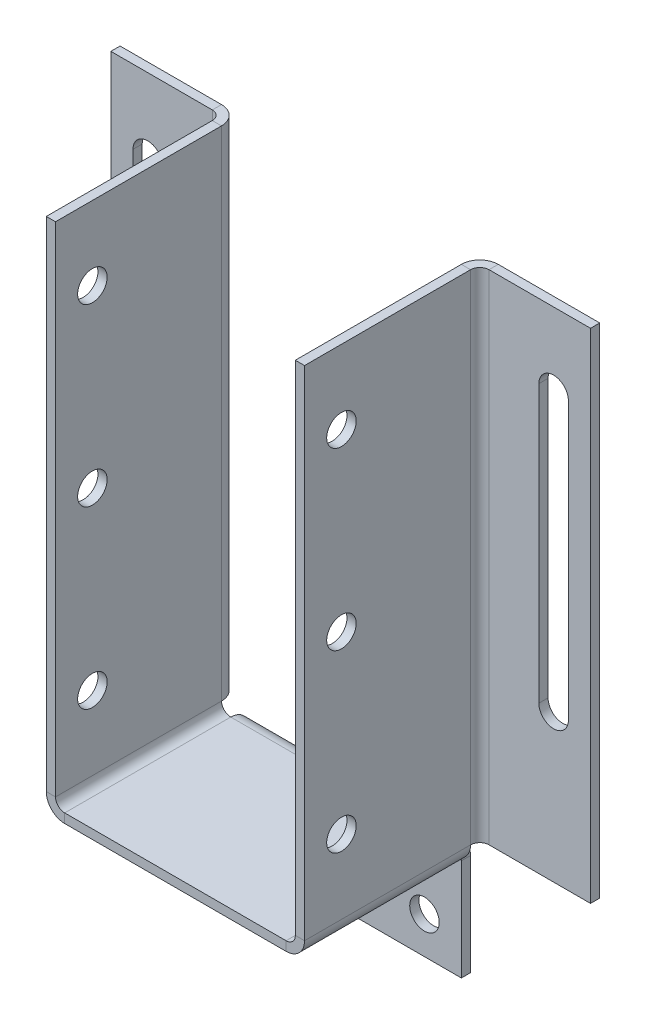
ISO-10303-21;
HEADER;
FILE_DESCRIPTION(('STEP AP214'),'2;1');
FILE_NAME('part.step','',(''),(''),'','','');
FILE_SCHEMA(('AUTOMOTIVE_DESIGN { 1 0 10303 214 1 1 1 1 }'));
ENDSEC;
DATA;
#1=APPLICATION_CONTEXT('core data for automotive mechanical design processes');
#2=APPLICATION_PROTOCOL_DEFINITION('international standard','automotive_design',2000,#1);
#3=PRODUCT_CONTEXT('',#1,'mechanical');
#4=PRODUCT('Part','Part','',(#3));
#5=PRODUCT_RELATED_PRODUCT_CATEGORY('part','',(#4));
#6=PRODUCT_DEFINITION_FORMATION('','',#4);
#7=PRODUCT_DEFINITION_CONTEXT('part definition',#1,'design');
#8=PRODUCT_DEFINITION('design','',#6,#7);
#9=PRODUCT_DEFINITION_SHAPE('','',#8);
#10=(LENGTH_UNIT() NAMED_UNIT(*) SI_UNIT(.MILLI.,.METRE.));
#11=(NAMED_UNIT(*) PLANE_ANGLE_UNIT() SI_UNIT($,.RADIAN.));
#12=(NAMED_UNIT(*) SI_UNIT($,.STERADIAN.) SOLID_ANGLE_UNIT());
#13=UNCERTAINTY_MEASURE_WITH_UNIT(LENGTH_MEASURE(1.E-05),#10,'distance_accuracy_value','');
#14=(GEOMETRIC_REPRESENTATION_CONTEXT(3) GLOBAL_UNCERTAINTY_ASSIGNED_CONTEXT((#13)) GLOBAL_UNIT_ASSIGNED_CONTEXT((#10,
#11,#12)) REPRESENTATION_CONTEXT('',''));
#15=CARTESIAN_POINT('',(0.,0.,0.));
#16=DIRECTION('',(0.,0.,1.));
#17=DIRECTION('',(1.,0.,0.));
#18=AXIS2_PLACEMENT_3D('',#15,#16,#17);
#19=CARTESIAN_POINT('',(19.05,1.5875,3.175));
#20=DIRECTION('',(0.,0.,-1.));
#21=DIRECTION('',(-1.,0.,0.));
#22=AXIS2_PLACEMENT_3D('',#19,#20,#21);
#23=PLANE('',#22);
#24=DIRECTION('',(0.,-1.,0.));
#25=VECTOR('',#24,1.);
#26=CARTESIAN_POINT('',(19.0500000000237,1.5875,3.175));
#27=LINE('',#26,#25);
#28=CARTESIAN_POINT('',(19.05,1.5875,3.175));
#29=VERTEX_POINT('',#28);
#30=CARTESIAN_POINT('',(19.05,0.,3.175));
#31=VERTEX_POINT('',#30);
#32=EDGE_CURVE('E463',#29,#31,#27,.T.);
#33=ORIENTED_EDGE('',*,*,#32,.F.);
#34=CARTESIAN_POINT('',(19.05,3.175,3.175));
#35=DIRECTION('',(0.,0.,1.));
#36=DIRECTION('',(1.,0.,0.));
#37=AXIS2_PLACEMENT_3D('',#34,#35,#36);
#38=CIRCLE('',#37,1.5875);
#39=CARTESIAN_POINT('',(20.6375,3.175,3.175));
#40=VERTEX_POINT('',#39);
#41=EDGE_CURVE('E544',#40,#29,#38,.F.);
#42=ORIENTED_EDGE('',*,*,#41,.F.);
#43=DIRECTION('',(1.,0.,0.));
#44=VECTOR('',#43,1.);
#45=CARTESIAN_POINT('',(20.6375,3.175,3.175));
#46=LINE('',#45,#44);
#47=CARTESIAN_POINT('',(22.225,3.175,3.175));
#48=VERTEX_POINT('',#47);
#49=EDGE_CURVE('E504',#40,#48,#46,.T.);
#50=ORIENTED_EDGE('',*,*,#49,.T.);
#51=CARTESIAN_POINT('',(19.05,3.175,3.175));
#52=DIRECTION('',(0.,0.,1.));
#53=DIRECTION('',(1.,0.,0.));
#54=AXIS2_PLACEMENT_3D('',#51,#52,#53);
#55=CIRCLE('',#54,3.175);
#56=EDGE_CURVE('E540',#48,#31,#55,.F.);
#57=ORIENTED_EDGE('',*,*,#56,.T.);
#58=EDGE_LOOP('',(#33,#42,#50,#57));
#59=FACE_BOUND('',#58,.T.);
#60=ADVANCED_FACE('F32',(#59),#23,.T.);
#61=CARTESIAN_POINT('',(0.,1.5875,31.75));
#62=DIRECTION('',(0.,-1.,0.));
#63=DIRECTION('',(0.,0.,-1.));
#64=AXIS2_PLACEMENT_3D('',#61,#62,#63);
#65=PLANE('',#64);
#66=DIRECTION('',(-1.,0.,0.));
#67=VECTOR('',#66,1.);
#68=CARTESIAN_POINT('',(19.0500000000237,1.5875,3.175));
#69=LINE('',#68,#67);
#70=CARTESIAN_POINT('',(-19.05,1.5875,3.175));
#71=VERTEX_POINT('',#70);
#72=EDGE_CURVE('E458',#29,#71,#69,.T.);
#73=ORIENTED_EDGE('',*,*,#72,.T.);
#74=DIRECTION('',(0.,0.,-1.));
#75=VECTOR('',#74,1.);
#76=CARTESIAN_POINT('',(-19.05,1.5875,31.75));
#77=LINE('',#76,#75);
#78=CARTESIAN_POINT('',(-19.05,1.5875,31.75));
#79=VERTEX_POINT('',#78);
#80=EDGE_CURVE('E380',#79,#71,#77,.T.);
#81=ORIENTED_EDGE('',*,*,#80,.F.);
#82=DIRECTION('',(1.,0.,0.));
#83=VECTOR('',#82,1.);
#84=CARTESIAN_POINT('',(0.,1.5875,31.75));
#85=LINE('',#84,#83);
#86=CARTESIAN_POINT('',(19.05,1.5875,31.75));
#87=VERTEX_POINT('',#86);
#88=EDGE_CURVE('E547',#87,#79,#85,.F.);
#89=ORIENTED_EDGE('',*,*,#88,.F.);
#90=DIRECTION('',(0.,0.,-1.));
#91=VECTOR('',#90,1.);
#92=CARTESIAN_POINT('',(19.05,1.5875,31.75));
#93=LINE('',#92,#91);
#94=EDGE_CURVE('E566',#87,#29,#93,.T.);
#95=ORIENTED_EDGE('',*,*,#94,.T.);
#96=EDGE_LOOP('',(#73,#81,#89,#95));
#97=FACE_BOUND('',#96,.T.);
#98=ADVANCED_FACE('F613',(#97),#65,.F.);
#99=CARTESIAN_POINT('',(0.,0.,31.75));
#100=DIRECTION('',(0.,-1.,0.));
#101=DIRECTION('',(0.,0.,-1.));
#102=AXIS2_PLACEMENT_3D('',#99,#100,#101);
#103=PLANE('',#102);
#104=DIRECTION('',(-1.,0.,0.));
#105=VECTOR('',#104,1.);
#106=CARTESIAN_POINT('',(0.,0.,31.75));
#107=LINE('',#106,#105);
#108=CARTESIAN_POINT('',(19.05,0.,31.75));
#109=VERTEX_POINT('',#108);
#110=CARTESIAN_POINT('',(-19.05,0.,31.75));
#111=VERTEX_POINT('',#110);
#112=EDGE_CURVE('E549',#109,#111,#107,.T.);
#113=ORIENTED_EDGE('',*,*,#112,.T.);
#114=DIRECTION('',(0.,0.,-1.));
#115=VECTOR('',#114,1.);
#116=CARTESIAN_POINT('',(-19.05,0.,31.75));
#117=LINE('',#116,#115);
#118=CARTESIAN_POINT('',(-19.05,0.,3.175));
#119=VERTEX_POINT('',#118);
#120=EDGE_CURVE('E395',#111,#119,#117,.T.);
#121=ORIENTED_EDGE('',*,*,#120,.T.);
#122=DIRECTION('',(-1.,0.,0.));
#123=VECTOR('',#122,1.);
#124=CARTESIAN_POINT('',(19.0500000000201,0.,3.175));
#125=LINE('',#124,#123);
#126=EDGE_CURVE('E461',#31,#119,#125,.T.);
#127=ORIENTED_EDGE('',*,*,#126,.F.);
#128=DIRECTION('',(0.,0.,-1.));
#129=VECTOR('',#128,1.);
#130=CARTESIAN_POINT('',(19.05,0.,31.75));
#131=LINE('',#130,#129);
#132=EDGE_CURVE('E581',#109,#31,#131,.T.);
#133=ORIENTED_EDGE('',*,*,#132,.F.);
#134=EDGE_LOOP('',(#113,#121,#127,#133));
#135=FACE_BOUND('',#134,.T.);
#136=ADVANCED_FACE('F646',(#135),#103,.T.);
#137=CARTESIAN_POINT('',(19.05,3.175,31.75));
#138=DIRECTION('',(0.,0.,-1.));
#139=DIRECTION('',(-1.,0.,0.));
#140=AXIS2_PLACEMENT_3D('',#137,#138,#139);
#141=CYLINDRICAL_SURFACE('',#140,3.175);
#142=ORIENTED_EDGE('',*,*,#132,.T.);
#143=ORIENTED_EDGE('',*,*,#56,.F.);
#144=DIRECTION('',(0.,0.,-1.));
#145=VECTOR('',#144,1.);
#146=CARTESIAN_POINT('',(22.225,3.175,31.75));
#147=LINE('',#146,#145);
#148=CARTESIAN_POINT('',(22.225,3.175,31.75));
#149=VERTEX_POINT('',#148);
#150=EDGE_CURVE('E578',#149,#48,#147,.T.);
#151=ORIENTED_EDGE('',*,*,#150,.F.);
#152=CARTESIAN_POINT('',(19.05,3.175,31.75));
#153=DIRECTION('',(0.,0.,1.));
#154=DIRECTION('',(1.,0.,0.));
#155=AXIS2_PLACEMENT_3D('',#152,#153,#154);
#156=CIRCLE('',#155,3.175);
#157=EDGE_CURVE('E551',#149,#109,#156,.F.);
#158=ORIENTED_EDGE('',*,*,#157,.T.);
#159=EDGE_LOOP('',(#142,#143,#151,#158));
#160=FACE_BOUND('',#159,.T.);
#161=ADVANCED_FACE('F594',(#160),#141,.T.);
#162=CARTESIAN_POINT('',(22.225,88.9,31.75));
#163=DIRECTION('',(1.,0.,0.));
#164=DIRECTION('',(0.,1.,0.));
#165=AXIS2_PLACEMENT_3D('',#162,#163,#164);
#166=PLANE('',#165);
#167=CARTESIAN_POINT('',(22.2250000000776,15.875,25.4));
#168=DIRECTION('',(1.,0.,0.));
#169=DIRECTION('',(0.,1.,0.));
#170=AXIS2_PLACEMENT_3D('',#167,#168,#169);
#171=CIRCLE('',#170,2.54);
#172=CARTESIAN_POINT('',(22.2250000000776,18.415,25.4));
#173=VERTEX_POINT('',#172);
#174=EDGE_CURVE('E403',#173,#173,#171,.T.);
#175=ORIENTED_EDGE('',*,*,#174,.F.);
#176=EDGE_LOOP('',(#175));
#177=FACE_BOUND('',#176,.T.);
#178=CARTESIAN_POINT('',(22.2250000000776,46.0375,25.4));
#179=DIRECTION('',(1.,0.,0.));
#180=DIRECTION('',(0.,1.,0.));
#181=AXIS2_PLACEMENT_3D('',#178,#179,#180);
#182=CIRCLE('',#181,2.54);
#183=CARTESIAN_POINT('',(22.2250000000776,48.5775,25.4));
#184=VERTEX_POINT('',#183);
#185=EDGE_CURVE('E409',#184,#184,#182,.T.);
#186=ORIENTED_EDGE('',*,*,#185,.F.);
#187=EDGE_LOOP('',(#186));
#188=FACE_BOUND('',#187,.T.);
#189=CARTESIAN_POINT('',(22.2250000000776,76.2,25.4));
#190=DIRECTION('',(1.,0.,0.));
#191=DIRECTION('',(0.,1.,0.));
#192=AXIS2_PLACEMENT_3D('',#189,#190,#191);
#193=CIRCLE('',#192,2.54);
#194=CARTESIAN_POINT('',(22.2250000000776,78.74,25.4));
#195=VERTEX_POINT('',#194);
#196=EDGE_CURVE('E415',#195,#195,#193,.T.);
#197=ORIENTED_EDGE('',*,*,#196,.F.);
#198=EDGE_LOOP('',(#197));
#199=FACE_BOUND('',#198,.T.);
#200=ORIENTED_EDGE('',*,*,#150,.T.);
#201=DIRECTION('',(0.,-1.,0.));
#202=VECTOR('',#201,1.);
#203=CARTESIAN_POINT('',(22.2249999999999,517.52500000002,3.175));
#204=LINE('',#203,#202);
#205=CARTESIAN_POINT('',(22.225,88.9000000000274,3.175));
#206=VERTEX_POINT('',#205);
#207=EDGE_CURVE('E496',#206,#48,#204,.T.);
#208=ORIENTED_EDGE('',*,*,#207,.F.);
#209=DIRECTION('',(0.,0.,-1.));
#210=VECTOR('',#209,1.);
#211=CARTESIAN_POINT('',(22.225,88.9,31.75));
#212=LINE('',#211,#210);
#213=CARTESIAN_POINT('',(22.225,88.9,31.75));
#214=VERTEX_POINT('',#213);
#215=EDGE_CURVE('E575',#214,#206,#212,.T.);
#216=ORIENTED_EDGE('',*,*,#215,.F.);
#217=DIRECTION('',(0.,-1.,0.));
#218=VECTOR('',#217,1.);
#219=CARTESIAN_POINT('',(22.225,88.9,31.75));
#220=LINE('',#219,#218);
#221=EDGE_CURVE('E554',#214,#149,#220,.T.);
#222=ORIENTED_EDGE('',*,*,#221,.T.);
#223=EDGE_LOOP('',(#200,#208,#216,#222));
#224=FACE_BOUND('',#223,.T.);
#225=ADVANCED_FACE('F598',(#177,#188,#199,#224),#166,.T.);
#226=CARTESIAN_POINT('',(20.6375,88.9,31.75));
#227=DIRECTION('',(0.,1.,0.));
#228=DIRECTION('',(0.,0.,1.));
#229=AXIS2_PLACEMENT_3D('',#226,#227,#228);
#230=PLANE('',#229);
#231=ORIENTED_EDGE('',*,*,#215,.T.);
#232=DIRECTION('',(1.,0.,0.));
#233=VECTOR('',#232,1.);
#234=CARTESIAN_POINT('',(20.6375,88.9000000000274,3.175));
#235=LINE('',#234,#233);
#236=CARTESIAN_POINT('',(20.6375,88.9000000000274,3.175));
#237=VERTEX_POINT('',#236);
#238=EDGE_CURVE('E507',#237,#206,#235,.T.);
#239=ORIENTED_EDGE('',*,*,#238,.F.);
#240=DIRECTION('',(0.,0.,-1.));
#241=VECTOR('',#240,1.);
#242=CARTESIAN_POINT('',(20.6375,88.9,31.75));
#243=LINE('',#242,#241);
#244=CARTESIAN_POINT('',(20.6375,88.9,31.75));
#245=VERTEX_POINT('',#244);
#246=EDGE_CURVE('E572',#245,#237,#243,.T.);
#247=ORIENTED_EDGE('',*,*,#246,.F.);
#248=DIRECTION('',(1.,0.,0.));
#249=VECTOR('',#248,1.);
#250=CARTESIAN_POINT('',(20.6375,88.9,31.75));
#251=LINE('',#250,#249);
#252=EDGE_CURVE('E557',#245,#214,#251,.T.);
#253=ORIENTED_EDGE('',*,*,#252,.T.);
#254=EDGE_LOOP('',(#231,#239,#247,#253));
#255=FACE_BOUND('',#254,.T.);
#256=ADVANCED_FACE('F601',(#255),#230,.T.);
#257=CARTESIAN_POINT('',(20.6375,88.9,31.75));
#258=DIRECTION('',(1.,0.,0.));
#259=DIRECTION('',(0.,1.,0.));
#260=AXIS2_PLACEMENT_3D('',#257,#258,#259);
#261=PLANE('',#260);
#262=CARTESIAN_POINT('',(20.6375,15.875,25.4));
#263=DIRECTION('',(1.,0.,0.));
#264=DIRECTION('',(0.,1.,0.));
#265=AXIS2_PLACEMENT_3D('',#262,#263,#264);
#266=CIRCLE('',#265,2.54);
#267=CARTESIAN_POINT('',(20.6375,18.415,25.4));
#268=VERTEX_POINT('',#267);
#269=EDGE_CURVE('E406',#268,#268,#266,.F.);
#270=ORIENTED_EDGE('',*,*,#269,.F.);
#271=EDGE_LOOP('',(#270));
#272=FACE_BOUND('',#271,.T.);
#273=CARTESIAN_POINT('',(20.6375,46.0375,25.4));
#274=DIRECTION('',(1.,0.,0.));
#275=DIRECTION('',(0.,1.,0.));
#276=AXIS2_PLACEMENT_3D('',#273,#274,#275);
#277=CIRCLE('',#276,2.54);
#278=CARTESIAN_POINT('',(20.6375,48.5775,25.4));
#279=VERTEX_POINT('',#278);
#280=EDGE_CURVE('E412',#279,#279,#277,.F.);
#281=ORIENTED_EDGE('',*,*,#280,.F.);
#282=EDGE_LOOP('',(#281));
#283=FACE_BOUND('',#282,.T.);
#284=CARTESIAN_POINT('',(20.6375,76.2,25.4));
#285=DIRECTION('',(1.,0.,0.));
#286=DIRECTION('',(0.,1.,0.));
#287=AXIS2_PLACEMENT_3D('',#284,#285,#286);
#288=CIRCLE('',#287,2.54);
#289=CARTESIAN_POINT('',(20.6375,78.74,25.4));
#290=VERTEX_POINT('',#289);
#291=EDGE_CURVE('E418',#290,#290,#288,.F.);
#292=ORIENTED_EDGE('',*,*,#291,.F.);
#293=EDGE_LOOP('',(#292));
#294=FACE_BOUND('',#293,.T.);
#295=DIRECTION('',(0.,-1.,0.));
#296=VECTOR('',#295,1.);
#297=CARTESIAN_POINT('',(20.6374999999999,517.525000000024,3.175));
#298=LINE('',#297,#296);
#299=EDGE_CURVE('E487',#237,#40,#298,.T.);
#300=ORIENTED_EDGE('',*,*,#299,.T.);
#301=DIRECTION('',(0.,0.,-1.));
#302=VECTOR('',#301,1.);
#303=CARTESIAN_POINT('',(20.6375,3.175,31.75));
#304=LINE('',#303,#302);
#305=CARTESIAN_POINT('',(20.6375,3.175,31.75));
#306=VERTEX_POINT('',#305);
#307=EDGE_CURVE('E569',#306,#40,#304,.T.);
#308=ORIENTED_EDGE('',*,*,#307,.F.);
#309=DIRECTION('',(0.,-1.,0.));
#310=VECTOR('',#309,1.);
#311=CARTESIAN_POINT('',(20.6375,88.9,31.75));
#312=LINE('',#311,#310);
#313=EDGE_CURVE('E560',#245,#306,#312,.T.);
#314=ORIENTED_EDGE('',*,*,#313,.F.);
#315=ORIENTED_EDGE('',*,*,#246,.T.);
#316=EDGE_LOOP('',(#300,#308,#314,#315));
#317=FACE_BOUND('',#316,.T.);
#318=ADVANCED_FACE('F603',(#272,#283,#294,#317),#261,.F.);
#319=CARTESIAN_POINT('',(19.05,3.175,31.75));
#320=DIRECTION('',(0.,0.,-1.));
#321=DIRECTION('',(-1.,0.,0.));
#322=AXIS2_PLACEMENT_3D('',#319,#320,#321);
#323=CYLINDRICAL_SURFACE('',#322,1.5875);
#324=ORIENTED_EDGE('',*,*,#41,.T.);
#325=ORIENTED_EDGE('',*,*,#94,.F.);
#326=CARTESIAN_POINT('',(19.05,3.175,31.75));
#327=DIRECTION('',(0.,0.,1.));
#328=DIRECTION('',(1.,0.,0.));
#329=AXIS2_PLACEMENT_3D('',#326,#327,#328);
#330=CIRCLE('',#329,1.5875);
#331=EDGE_CURVE('E563',#306,#87,#330,.F.);
#332=ORIENTED_EDGE('',*,*,#331,.F.);
#333=ORIENTED_EDGE('',*,*,#307,.T.);
#334=EDGE_LOOP('',(#324,#325,#332,#333));
#335=FACE_BOUND('',#334,.T.);
#336=ADVANCED_FACE('F607',(#335),#323,.F.);
#337=CARTESIAN_POINT('',(19.05,0.,31.75));
#338=DIRECTION('',(0.,0.,1.));
#339=DIRECTION('',(1.,0.,0.));
#340=AXIS2_PLACEMENT_3D('',#337,#338,#339);
#341=PLANE('',#340);
#342=DIRECTION('',(0.,1.,0.));
#343=VECTOR('',#342,1.);
#344=CARTESIAN_POINT('',(19.05,0.,31.75));
#345=LINE('',#344,#343);
#346=EDGE_CURVE('E11',#109,#87,#345,.T.);
#347=ORIENTED_EDGE('',*,*,#346,.F.);
#348=ORIENTED_EDGE('',*,*,#157,.F.);
#349=DIRECTION('',(1.,0.,0.));
#350=VECTOR('',#349,1.);
#351=CARTESIAN_POINT('',(20.6375,3.175,31.75));
#352=LINE('',#351,#350);
#353=EDGE_CURVE('E40',#306,#149,#352,.T.);
#354=ORIENTED_EDGE('',*,*,#353,.F.);
#355=ORIENTED_EDGE('',*,*,#331,.T.);
#356=EDGE_LOOP('',(#347,#348,#354,#355));
#357=FACE_BOUND('',#356,.T.);
#358=ADVANCED_FACE('F34',(#357),#341,.T.);
#359=CARTESIAN_POINT('',(20.6375,3.175,31.75));
#360=DIRECTION('',(0.,0.,1.));
#361=DIRECTION('',(1.,0.,0.));
#362=AXIS2_PLACEMENT_3D('',#359,#360,#361);
#363=PLANE('',#362);
#364=ORIENTED_EDGE('',*,*,#112,.F.);
#365=ORIENTED_EDGE('',*,*,#346,.T.);
#366=ORIENTED_EDGE('',*,*,#88,.T.);
#367=DIRECTION('',(0.,1.,0.));
#368=VECTOR('',#367,1.);
#369=CARTESIAN_POINT('',(-19.05,0.,31.75));
#370=LINE('',#369,#368);
#371=EDGE_CURVE('E400',#111,#79,#370,.T.);
#372=ORIENTED_EDGE('',*,*,#371,.F.);
#373=EDGE_LOOP('',(#364,#365,#366,#372));
#374=FACE_BOUND('',#373,.T.);
#375=ADVANCED_FACE('F617',(#374),#363,.T.);
#376=CARTESIAN_POINT('',(19.05,3.175,31.75));
#377=DIRECTION('',(0.,0.,1.));
#378=DIRECTION('',(1.,0.,0.));
#379=AXIS2_PLACEMENT_3D('',#376,#377,#378);
#380=PLANE('',#379);
#381=ORIENTED_EDGE('',*,*,#313,.T.);
#382=ORIENTED_EDGE('',*,*,#353,.T.);
#383=ORIENTED_EDGE('',*,*,#221,.F.);
#384=ORIENTED_EDGE('',*,*,#252,.F.);
#385=EDGE_LOOP('',(#381,#382,#383,#384));
#386=FACE_BOUND('',#385,.T.);
#387=ADVANCED_FACE('F586',(#386),#380,.T.);
#388=CARTESIAN_POINT('',(41.275,88.9,0.));
#389=DIRECTION('',(-1.,0.,0.));
#390=DIRECTION('',(0.,-1.,0.));
#391=AXIS2_PLACEMENT_3D('',#388,#389,#390);
#392=PLANE('',#391);
#393=DIRECTION('',(0.,0.,1.));
#394=VECTOR('',#393,1.);
#395=CARTESIAN_POINT('',(41.275,3.175,0.));
#396=LINE('',#395,#394);
#397=CARTESIAN_POINT('',(41.275,3.175,0.));
#398=VERTEX_POINT('',#397);
#399=CARTESIAN_POINT('',(41.275,3.175,1.5875));
#400=VERTEX_POINT('',#399);
#401=EDGE_CURVE('E538',#398,#400,#396,.T.);
#402=ORIENTED_EDGE('',*,*,#401,.F.);
#403=DIRECTION('',(0.,-1.,0.));
#404=VECTOR('',#403,1.);
#405=CARTESIAN_POINT('',(41.275,88.9,0.));
#406=LINE('',#405,#404);
#407=CARTESIAN_POINT('',(41.275,88.9,0.));
#408=VERTEX_POINT('',#407);
#409=EDGE_CURVE('E509',#408,#398,#406,.T.);
#410=ORIENTED_EDGE('',*,*,#409,.F.);
#411=DIRECTION('',(0.,0.,1.));
#412=VECTOR('',#411,1.);
#413=CARTESIAN_POINT('',(41.275,88.9,0.));
#414=LINE('',#413,#412);
#415=CARTESIAN_POINT('',(41.275,88.9,1.5875));
#416=VERTEX_POINT('',#415);
#417=EDGE_CURVE('E536',#408,#416,#414,.T.);
#418=ORIENTED_EDGE('',*,*,#417,.T.);
#419=DIRECTION('',(0.,1.,0.));
#420=VECTOR('',#419,1.);
#421=CARTESIAN_POINT('',(41.275,88.9,1.5875));
#422=LINE('',#421,#420);
#423=EDGE_CURVE('E520',#416,#400,#422,.F.);
#424=ORIENTED_EDGE('',*,*,#423,.T.);
#425=EDGE_LOOP('',(#402,#410,#418,#424));
#426=FACE_BOUND('',#425,.T.);
#427=ADVANCED_FACE('F724',(#426),#392,.F.);
#428=CARTESIAN_POINT('',(41.275,88.9,0.));
#429=DIRECTION('',(1.15057031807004E-12,1.,0.));
#430=DIRECTION('',(-1.,1.15057031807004E-12,0.));
#431=AXIS2_PLACEMENT_3D('',#428,#429,#430);
#432=PLANE('',#431);
#433=ORIENTED_EDGE('',*,*,#417,.F.);
#434=DIRECTION('',(-1.,1.15057031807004E-12,0.));
#435=VECTOR('',#434,1.);
#436=CARTESIAN_POINT('',(41.275,88.9,0.));
#437=LINE('',#436,#435);
#438=CARTESIAN_POINT('',(23.8125,88.9000000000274,0.));
#439=VERTEX_POINT('',#438);
#440=EDGE_CURVE('E510',#408,#439,#437,.T.);
#441=ORIENTED_EDGE('',*,*,#440,.T.);
#442=DIRECTION('',(0.,0.,1.));
#443=VECTOR('',#442,1.);
#444=CARTESIAN_POINT('',(23.8125,88.9000000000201,0.));
#445=LINE('',#444,#443);
#446=CARTESIAN_POINT('',(23.8125,88.9000000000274,1.5875));
#447=VERTEX_POINT('',#446);
#448=EDGE_CURVE('E533',#439,#447,#445,.T.);
#449=ORIENTED_EDGE('',*,*,#448,.T.);
#450=DIRECTION('',(1.,0.,0.));
#451=VECTOR('',#450,1.);
#452=CARTESIAN_POINT('',(41.275,88.9,1.5875));
#453=LINE('',#452,#451);
#454=EDGE_CURVE('E525',#416,#447,#453,.F.);
#455=ORIENTED_EDGE('',*,*,#454,.F.);
#456=EDGE_LOOP('',(#433,#441,#449,#455));
#457=FACE_BOUND('',#456,.T.);
#458=ADVANCED_FACE('F756',(#457),#432,.T.);
#459=CARTESIAN_POINT('',(41.275,3.175,0.));
#460=DIRECTION('',(0.,-1.,0.));
#461=DIRECTION('',(1.,0.,0.));
#462=AXIS2_PLACEMENT_3D('',#459,#460,#461);
#463=PLANE('',#462);
#464=DIRECTION('',(1.,0.,0.));
#465=VECTOR('',#464,1.);
#466=CARTESIAN_POINT('',(41.275,3.175,0.));
#467=LINE('',#466,#465);
#468=CARTESIAN_POINT('',(23.8125,3.175,0.));
#469=VERTEX_POINT('',#468);
#470=EDGE_CURVE('E517',#469,#398,#467,.T.);
#471=ORIENTED_EDGE('',*,*,#470,.T.);
#472=ORIENTED_EDGE('',*,*,#401,.T.);
#473=DIRECTION('',(1.,0.,0.));
#474=VECTOR('',#473,1.);
#475=CARTESIAN_POINT('',(41.275,3.175,1.5875));
#476=LINE('',#475,#474);
#477=CARTESIAN_POINT('',(23.8125,3.175,1.5875));
#478=VERTEX_POINT('',#477);
#479=EDGE_CURVE('E524',#478,#400,#476,.T.);
#480=ORIENTED_EDGE('',*,*,#479,.F.);
#481=DIRECTION('',(0.,0.,1.));
#482=VECTOR('',#481,1.);
#483=CARTESIAN_POINT('',(23.8125,3.175,0.));
#484=LINE('',#483,#482);
#485=EDGE_CURVE('E532',#469,#478,#484,.T.);
#486=ORIENTED_EDGE('',*,*,#485,.F.);
#487=EDGE_LOOP('',(#471,#472,#480,#486));
#488=FACE_BOUND('',#487,.T.);
#489=ADVANCED_FACE('F720',(#488),#463,.T.);
#490=CARTESIAN_POINT('',(41.275,88.9,1.5875));
#491=DIRECTION('',(0.,0.,1.));
#492=DIRECTION('',(1.,0.,0.));
#493=AXIS2_PLACEMENT_3D('',#490,#491,#492);
#494=PLANE('',#493);
#495=CARTESIAN_POINT('',(34.925,76.2,1.5875));
#496=DIRECTION('',(0.,0.,1.));
#497=DIRECTION('',(1.,0.,0.));
#498=AXIS2_PLACEMENT_3D('',#495,#496,#497);
#499=CIRCLE('',#498,2.54);
#500=CARTESIAN_POINT('',(37.465,76.2,1.5875));
#501=VERTEX_POINT('',#500);
#502=CARTESIAN_POINT('',(32.385,76.2,1.5875));
#503=VERTEX_POINT('',#502);
#504=EDGE_CURVE('E47',#501,#503,#499,.T.);
#505=ORIENTED_EDGE('',*,*,#504,.F.);
#506=DIRECTION('',(0.,1.,0.));
#507=VECTOR('',#506,1.);
#508=CARTESIAN_POINT('',(37.465,76.2,1.5875));
#509=LINE('',#508,#507);
#510=CARTESIAN_POINT('',(37.465,28.575,1.5875));
#511=VERTEX_POINT('',#510);
#512=EDGE_CURVE('E434',#511,#501,#509,.T.);
#513=ORIENTED_EDGE('',*,*,#512,.F.);
#514=CARTESIAN_POINT('',(34.925,28.575,1.5875));
#515=DIRECTION('',(0.,0.,1.));
#516=DIRECTION('',(1.,0.,0.));
#517=AXIS2_PLACEMENT_3D('',#514,#515,#516);
#518=CIRCLE('',#517,2.54);
#519=CARTESIAN_POINT('',(32.385,28.575,1.5875));
#520=VERTEX_POINT('',#519);
#521=EDGE_CURVE('E431',#520,#511,#518,.T.);
#522=ORIENTED_EDGE('',*,*,#521,.F.);
#523=DIRECTION('',(0.,-1.,0.));
#524=VECTOR('',#523,1.);
#525=CARTESIAN_POINT('',(32.385,76.2,1.5875));
#526=LINE('',#525,#524);
#527=EDGE_CURVE('E428',#503,#520,#526,.T.);
#528=ORIENTED_EDGE('',*,*,#527,.F.);
#529=EDGE_LOOP('',(#505,#513,#522,#528));
#530=FACE_BOUND('',#529,.T.);
#531=DIRECTION('',(0.,1.,0.));
#532=VECTOR('',#531,1.);
#533=CARTESIAN_POINT('',(23.8125,88.9,1.5875));
#534=LINE('',#533,#532);
#535=EDGE_CURVE('E521',#447,#478,#534,.F.);
#536=ORIENTED_EDGE('',*,*,#535,.T.);
#537=ORIENTED_EDGE('',*,*,#479,.T.);
#538=ORIENTED_EDGE('',*,*,#423,.F.);
#539=ORIENTED_EDGE('',*,*,#454,.T.);
#540=EDGE_LOOP('',(#536,#537,#538,#539));
#541=FACE_BOUND('',#540,.T.);
#542=ADVANCED_FACE('F766',(#530,#541),#494,.T.);
#543=CARTESIAN_POINT('',(41.275,88.9,0.));
#544=DIRECTION('',(0.,0.,1.));
#545=DIRECTION('',(1.,0.,0.));
#546=AXIS2_PLACEMENT_3D('',#543,#544,#545);
#547=PLANE('',#546);
#548=DIRECTION('',(0.,1.,0.));
#549=VECTOR('',#548,1.);
#550=CARTESIAN_POINT('',(37.465,76.2,0.));
#551=LINE('',#550,#549);
#552=CARTESIAN_POINT('',(37.465,28.575,0.));
#553=VERTEX_POINT('',#552);
#554=CARTESIAN_POINT('',(37.465,76.2,0.));
#555=VERTEX_POINT('',#554);
#556=EDGE_CURVE('E444',#553,#555,#551,.T.);
#557=ORIENTED_EDGE('',*,*,#556,.T.);
#558=CARTESIAN_POINT('',(34.925,76.2,0.));
#559=DIRECTION('',(0.,0.,1.));
#560=DIRECTION('',(1.,0.,0.));
#561=AXIS2_PLACEMENT_3D('',#558,#559,#560);
#562=CIRCLE('',#561,2.54);
#563=CARTESIAN_POINT('',(32.385,76.2,0.));
#564=VERTEX_POINT('',#563);
#565=EDGE_CURVE('E437',#555,#564,#562,.T.);
#566=ORIENTED_EDGE('',*,*,#565,.T.);
#567=DIRECTION('',(0.,-1.,0.));
#568=VECTOR('',#567,1.);
#569=CARTESIAN_POINT('',(32.385,76.2,0.));
#570=LINE('',#569,#568);
#571=CARTESIAN_POINT('',(32.385,28.575,0.));
#572=VERTEX_POINT('',#571);
#573=EDGE_CURVE('E440',#564,#572,#570,.T.);
#574=ORIENTED_EDGE('',*,*,#573,.T.);
#575=CARTESIAN_POINT('',(34.925,28.575,0.));
#576=DIRECTION('',(0.,0.,1.));
#577=DIRECTION('',(1.,0.,0.));
#578=AXIS2_PLACEMENT_3D('',#575,#576,#577);
#579=CIRCLE('',#578,2.54);
#580=EDGE_CURVE('E55',#572,#553,#579,.T.);
#581=ORIENTED_EDGE('',*,*,#580,.T.);
#582=EDGE_LOOP('',(#557,#566,#574,#581));
#583=FACE_BOUND('',#582,.T.);
#584=DIRECTION('',(0.,-1.,0.));
#585=VECTOR('',#584,1.);
#586=CARTESIAN_POINT('',(23.8125,88.9000000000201,0.));
#587=LINE('',#586,#585);
#588=EDGE_CURVE('E513',#439,#469,#587,.T.);
#589=ORIENTED_EDGE('',*,*,#588,.F.);
#590=ORIENTED_EDGE('',*,*,#440,.F.);
#591=ORIENTED_EDGE('',*,*,#409,.T.);
#592=ORIENTED_EDGE('',*,*,#470,.F.);
#593=EDGE_LOOP('',(#589,#590,#591,#592));
#594=FACE_BOUND('',#593,.T.);
#595=ADVANCED_FACE('F774',(#583,#594),#547,.F.);
#596=CARTESIAN_POINT('',(23.8125,3.175,3.175));
#597=DIRECTION('',(0.,1.,0.));
#598=DIRECTION('',(-1.,0.,0.));
#599=AXIS2_PLACEMENT_3D('',#596,#597,#598);
#600=PLANE('',#599);
#601=ORIENTED_EDGE('',*,*,#49,.F.);
#602=CARTESIAN_POINT('',(23.8125,3.175,3.175));
#603=DIRECTION('',(0.,-1.,0.));
#604=DIRECTION('',(1.,0.,0.));
#605=AXIS2_PLACEMENT_3D('',#602,#603,#604);
#606=CIRCLE('',#605,3.175);
#607=EDGE_CURVE('E490',#40,#469,#606,.T.);
#608=ORIENTED_EDGE('',*,*,#607,.T.);
#609=ORIENTED_EDGE('',*,*,#485,.T.);
#610=CARTESIAN_POINT('',(23.8125,3.17500000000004,3.175));
#611=DIRECTION('',(0.,-1.,0.));
#612=DIRECTION('',(1.,0.,0.));
#613=AXIS2_PLACEMENT_3D('',#610,#611,#612);
#614=CIRCLE('',#613,1.5875);
#615=EDGE_CURVE('E497',#48,#478,#614,.T.);
#616=ORIENTED_EDGE('',*,*,#615,.F.);
#617=EDGE_LOOP('',(#601,#608,#609,#616));
#618=FACE_BOUND('',#617,.T.);
#619=ADVANCED_FACE('F789',(#618),#600,.F.);
#620=CARTESIAN_POINT('',(23.8125,88.9000000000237,3.175));
#621=DIRECTION('',(0.,-1.,1.14963594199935E-12));
#622=DIRECTION('',(0.,-1.14963594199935E-12,-1.));
#623=AXIS2_PLACEMENT_3D('',#620,#621,#622);
#624=PLANE('',#623);
#625=CARTESIAN_POINT('',(23.8125,88.9000000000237,3.175));
#626=DIRECTION('',(0.,1.,-1.14963594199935E-12));
#627=DIRECTION('',(0.,1.14963594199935E-12,1.));
#628=AXIS2_PLACEMENT_3D('',#625,#626,#627);
#629=CIRCLE('',#628,3.175);
#630=EDGE_CURVE('E493',#439,#237,#629,.T.);
#631=ORIENTED_EDGE('',*,*,#630,.T.);
#632=ORIENTED_EDGE('',*,*,#238,.T.);
#633=CARTESIAN_POINT('',(23.8125,88.9000000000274,3.175));
#634=DIRECTION('',(0.,-1.,0.));
#635=DIRECTION('',(1.,0.,0.));
#636=AXIS2_PLACEMENT_3D('',#633,#634,#635);
#637=CIRCLE('',#636,1.5875);
#638=EDGE_CURVE('E499',#447,#206,#637,.F.);
#639=ORIENTED_EDGE('',*,*,#638,.F.);
#640=ORIENTED_EDGE('',*,*,#448,.F.);
#641=EDGE_LOOP('',(#631,#632,#639,#640));
#642=FACE_BOUND('',#641,.T.);
#643=ADVANCED_FACE('F798',(#642),#624,.F.);
#644=CARTESIAN_POINT('',(23.8124999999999,517.52500000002,3.175));
#645=DIRECTION('',(0.,-1.,0.));
#646=DIRECTION('',(1.,0.,0.));
#647=AXIS2_PLACEMENT_3D('',#644,#645,#646);
#648=CYLINDRICAL_SURFACE('',#647,1.5875);
#649=ORIENTED_EDGE('',*,*,#535,.F.);
#650=ORIENTED_EDGE('',*,*,#638,.T.);
#651=ORIENTED_EDGE('',*,*,#207,.T.);
#652=ORIENTED_EDGE('',*,*,#615,.T.);
#653=EDGE_LOOP('',(#649,#650,#651,#652));
#654=FACE_BOUND('',#653,.T.);
#655=ADVANCED_FACE('F801',(#654),#648,.F.);
#656=CARTESIAN_POINT('',(23.8124999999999,517.52500000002,3.175));
#657=DIRECTION('',(0.,-1.,0.));
#658=DIRECTION('',(1.,0.,0.));
#659=AXIS2_PLACEMENT_3D('',#656,#657,#658);
#660=CYLINDRICAL_SURFACE('',#659,3.175);
#661=ORIENTED_EDGE('',*,*,#588,.T.);
#662=ORIENTED_EDGE('',*,*,#607,.F.);
#663=ORIENTED_EDGE('',*,*,#299,.F.);
#664=ORIENTED_EDGE('',*,*,#630,.F.);
#665=EDGE_LOOP('',(#661,#662,#663,#664));
#666=FACE_BOUND('',#665,.T.);
#667=ADVANCED_FACE('F810',(#666),#660,.T.);
#668=CARTESIAN_POINT('',(19.05,-19.05,0.));
#669=DIRECTION('',(0.,1.,0.));
#670=DIRECTION('',(-1.,0.,0.));
#671=AXIS2_PLACEMENT_3D('',#668,#669,#670);
#672=PLANE('',#671);
#673=DIRECTION('',(1.,0.,0.));
#674=VECTOR('',#673,1.);
#675=CARTESIAN_POINT('',(19.05,-19.05,1.5875));
#676=LINE('',#675,#674);
#677=CARTESIAN_POINT('',(19.05,-19.05,1.5875));
#678=VERTEX_POINT('',#677);
#679=CARTESIAN_POINT('',(-19.05,-19.05,1.5875));
#680=VERTEX_POINT('',#679);
#681=EDGE_CURVE('E475',#678,#680,#676,.F.);
#682=ORIENTED_EDGE('',*,*,#681,.T.);
#683=DIRECTION('',(0.,0.,1.));
#684=VECTOR('',#683,1.);
#685=CARTESIAN_POINT('',(-19.05,-19.05,0.));
#686=LINE('',#685,#684);
#687=CARTESIAN_POINT('',(-19.05,-19.05,0.));
#688=VERTEX_POINT('',#687);
#689=EDGE_CURVE('E303',#688,#680,#686,.T.);
#690=ORIENTED_EDGE('',*,*,#689,.F.);
#691=DIRECTION('',(-1.,0.,0.));
#692=VECTOR('',#691,1.);
#693=CARTESIAN_POINT('',(19.05,-19.05,0.));
#694=LINE('',#693,#692);
#695=CARTESIAN_POINT('',(19.05,-19.05,0.));
#696=VERTEX_POINT('',#695);
#697=EDGE_CURVE('E468',#696,#688,#694,.T.);
#698=ORIENTED_EDGE('',*,*,#697,.F.);
#699=DIRECTION('',(0.,0.,1.));
#700=VECTOR('',#699,1.);
#701=CARTESIAN_POINT('',(19.05,-19.05,0.));
#702=LINE('',#701,#700);
#703=EDGE_CURVE('E485',#696,#678,#702,.T.);
#704=ORIENTED_EDGE('',*,*,#703,.T.);
#705=EDGE_LOOP('',(#682,#690,#698,#704));
#706=FACE_BOUND('',#705,.T.);
#707=ADVANCED_FACE('F825',(#706),#672,.F.);
#708=CARTESIAN_POINT('',(19.05,-19.05,0.));
#709=DIRECTION('',(1.,-1.1500649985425E-12,0.));
#710=DIRECTION('',(1.1500649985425E-12,1.,0.));
#711=AXIS2_PLACEMENT_3D('',#708,#709,#710);
#712=PLANE('',#711);
#713=ORIENTED_EDGE('',*,*,#703,.F.);
#714=DIRECTION('',(1.1500649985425E-12,1.,0.));
#715=VECTOR('',#714,1.);
#716=CARTESIAN_POINT('',(19.05,-19.05,0.));
#717=LINE('',#716,#715);
#718=CARTESIAN_POINT('',(19.0500000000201,-1.5875,0.));
#719=VERTEX_POINT('',#718);
#720=EDGE_CURVE('E469',#696,#719,#717,.T.);
#721=ORIENTED_EDGE('',*,*,#720,.T.);
#722=DIRECTION('',(0.,0.,1.));
#723=VECTOR('',#722,1.);
#724=CARTESIAN_POINT('',(19.0500000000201,-1.5875,0.));
#725=LINE('',#724,#723);
#726=CARTESIAN_POINT('',(19.0500000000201,-1.5875,1.5875));
#727=VERTEX_POINT('',#726);
#728=EDGE_CURVE('E478',#719,#727,#725,.T.);
#729=ORIENTED_EDGE('',*,*,#728,.T.);
#730=DIRECTION('',(0.,-1.,0.));
#731=VECTOR('',#730,1.);
#732=CARTESIAN_POINT('',(19.05,-19.05,1.5875));
#733=LINE('',#732,#731);
#734=EDGE_CURVE('E479',#678,#727,#733,.F.);
#735=ORIENTED_EDGE('',*,*,#734,.F.);
#736=EDGE_LOOP('',(#713,#721,#729,#735));
#737=FACE_BOUND('',#736,.T.);
#738=ADVANCED_FACE('F662',(#737),#712,.T.);
#739=CARTESIAN_POINT('',(19.05,-19.05,1.5875));
#740=DIRECTION('',(0.,0.,1.));
#741=DIRECTION('',(0.,-1.,0.));
#742=AXIS2_PLACEMENT_3D('',#739,#740,#741);
#743=PLANE('',#742);
#744=CARTESIAN_POINT('',(12.7,-12.7,1.5875));
#745=DIRECTION('',(0.,0.,1.));
#746=DIRECTION('',(1.,0.,0.));
#747=AXIS2_PLACEMENT_3D('',#744,#745,#746);
#748=CIRCLE('',#747,2.54);
#749=CARTESIAN_POINT('',(15.24,-12.7,1.5875));
#750=VERTEX_POINT('',#749);
#751=EDGE_CURVE('E421',#750,#750,#748,.F.);
#752=ORIENTED_EDGE('',*,*,#751,.T.);
#753=EDGE_LOOP('',(#752));
#754=FACE_BOUND('',#753,.T.);
#755=DIRECTION('',(1.,0.,0.));
#756=VECTOR('',#755,1.);
#757=CARTESIAN_POINT('',(19.05,-1.5875,1.5875));
#758=LINE('',#757,#756);
#759=CARTESIAN_POINT('',(-19.0500000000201,-1.5875,1.5875));
#760=VERTEX_POINT('',#759);
#761=EDGE_CURVE('E476',#727,#760,#758,.F.);
#762=ORIENTED_EDGE('',*,*,#761,.T.);
#763=DIRECTION('',(0.,-1.,0.));
#764=VECTOR('',#763,1.);
#765=CARTESIAN_POINT('',(-19.05,-19.05,1.5875));
#766=LINE('',#765,#764);
#767=EDGE_CURVE('E297',#680,#760,#766,.F.);
#768=ORIENTED_EDGE('',*,*,#767,.F.);
#769=ORIENTED_EDGE('',*,*,#681,.F.);
#770=ORIENTED_EDGE('',*,*,#734,.T.);
#771=EDGE_LOOP('',(#762,#768,#769,#770));
#772=FACE_BOUND('',#771,.T.);
#773=CARTESIAN_POINT('',(-12.7,-12.7,1.5875));
#774=DIRECTION('',(0.,0.,-1.));
#775=DIRECTION('',(-1.,0.,0.));
#776=AXIS2_PLACEMENT_3D('',#773,#774,#775);
#777=CIRCLE('',#776,2.54);
#778=CARTESIAN_POINT('',(-15.24,-12.7,1.5875));
#779=VERTEX_POINT('',#778);
#780=EDGE_CURVE('E1309',#779,#779,#777,.F.);
#781=ORIENTED_EDGE('',*,*,#780,.F.);
#782=EDGE_LOOP('',(#781));
#783=FACE_BOUND('',#782,.T.);
#784=ADVANCED_FACE('F657',(#754,#772,#783),#743,.T.);
#785=CARTESIAN_POINT('',(19.05,-19.05,0.));
#786=DIRECTION('',(0.,0.,1.));
#787=DIRECTION('',(0.,-1.,0.));
#788=AXIS2_PLACEMENT_3D('',#785,#786,#787);
#789=PLANE('',#788);
#790=CARTESIAN_POINT('',(12.7,-12.7,0.));
#791=DIRECTION('',(0.,0.,-1.));
#792=DIRECTION('',(-1.,0.,0.));
#793=AXIS2_PLACEMENT_3D('',#790,#791,#792);
#794=CIRCLE('',#793,2.54);
#795=CARTESIAN_POINT('',(10.16,-12.7,0.));
#796=VERTEX_POINT('',#795);
#797=EDGE_CURVE('E422',#796,#796,#794,.T.);
#798=ORIENTED_EDGE('',*,*,#797,.F.);
#799=EDGE_LOOP('',(#798));
#800=FACE_BOUND('',#799,.T.);
#801=DIRECTION('',(-1.,0.,0.));
#802=VECTOR('',#801,1.);
#803=CARTESIAN_POINT('',(19.0500000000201,-1.5875,0.));
#804=LINE('',#803,#802);
#805=CARTESIAN_POINT('',(-19.0500000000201,-1.5875,0.));
#806=VERTEX_POINT('',#805);
#807=EDGE_CURVE('E472',#719,#806,#804,.T.);
#808=ORIENTED_EDGE('',*,*,#807,.F.);
#809=ORIENTED_EDGE('',*,*,#720,.F.);
#810=ORIENTED_EDGE('',*,*,#697,.T.);
#811=DIRECTION('',(-1.1500649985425E-12,1.,0.));
#812=VECTOR('',#811,1.);
#813=CARTESIAN_POINT('',(-19.05,-19.05,0.));
#814=LINE('',#813,#812);
#815=EDGE_CURVE('E294',#688,#806,#814,.T.);
#816=ORIENTED_EDGE('',*,*,#815,.T.);
#817=EDGE_LOOP('',(#808,#809,#810,#816));
#818=FACE_BOUND('',#817,.T.);
#819=CARTESIAN_POINT('',(-12.7,-12.7,0.));
#820=DIRECTION('',(0.,0.,1.));
#821=DIRECTION('',(1.,0.,0.));
#822=AXIS2_PLACEMENT_3D('',#819,#820,#821);
#823=CIRCLE('',#822,2.54);
#824=CARTESIAN_POINT('',(-10.16,-12.7,0.));
#825=VERTEX_POINT('',#824);
#826=EDGE_CURVE('E267',#825,#825,#823,.T.);
#827=ORIENTED_EDGE('',*,*,#826,.T.);
#828=EDGE_LOOP('',(#827));
#829=FACE_BOUND('',#828,.T.);
#830=ADVANCED_FACE('F669',(#800,#818,#829),#789,.F.);
#831=CARTESIAN_POINT('',(19.0500000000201,-1.5875,3.175));
#832=DIRECTION('',(1.,-1.1500649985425E-12,0.));
#833=DIRECTION('',(1.1500649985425E-12,1.,0.));
#834=AXIS2_PLACEMENT_3D('',#831,#832,#833);
#835=PLANE('',#834);
#836=ORIENTED_EDGE('',*,*,#728,.F.);
#837=CARTESIAN_POINT('',(19.0500000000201,-1.5875,3.175));
#838=DIRECTION('',(-1.,1.1500649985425E-12,0.));
#839=DIRECTION('',(-1.1500649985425E-12,-1.,0.));
#840=AXIS2_PLACEMENT_3D('',#837,#838,#839);
#841=CIRCLE('',#840,3.175);
#842=EDGE_CURVE('E450',#719,#29,#841,.F.);
#843=ORIENTED_EDGE('',*,*,#842,.T.);
#844=ORIENTED_EDGE('',*,*,#32,.T.);
#845=CARTESIAN_POINT('',(19.0500000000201,-1.5875,3.175));
#846=DIRECTION('',(-1.,0.,0.));
#847=DIRECTION('',(0.,-1.,0.));
#848=AXIS2_PLACEMENT_3D('',#845,#846,#847);
#849=CIRCLE('',#848,1.5875);
#850=EDGE_CURVE('E460',#727,#31,#849,.F.);
#851=ORIENTED_EDGE('',*,*,#850,.F.);
#852=EDGE_LOOP('',(#836,#843,#844,#851));
#853=FACE_BOUND('',#852,.T.);
#854=ADVANCED_FACE('F649',(#853),#835,.T.);
#855=CARTESIAN_POINT('',(19.0500000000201,-1.5875,3.175));
#856=DIRECTION('',(-1.,0.,0.));
#857=DIRECTION('',(0.,-1.,0.));
#858=AXIS2_PLACEMENT_3D('',#855,#856,#857);
#859=CYLINDRICAL_SURFACE('',#858,1.5875);
#860=ORIENTED_EDGE('',*,*,#126,.T.);
#861=CARTESIAN_POINT('',(-19.0500000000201,-1.5875,3.175));
#862=DIRECTION('',(-1.,0.,0.));
#863=DIRECTION('',(0.,-1.,0.));
#864=AXIS2_PLACEMENT_3D('',#861,#862,#863);
#865=CIRCLE('',#864,1.5875);
#866=EDGE_CURVE('E288',#760,#119,#865,.F.);
#867=ORIENTED_EDGE('',*,*,#866,.F.);
#868=ORIENTED_EDGE('',*,*,#761,.F.);
#869=ORIENTED_EDGE('',*,*,#850,.T.);
#870=EDGE_LOOP('',(#860,#867,#868,#869));
#871=FACE_BOUND('',#870,.T.);
#872=ADVANCED_FACE('F653',(#871),#859,.F.);
#873=CARTESIAN_POINT('',(19.0500000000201,-1.5875,3.175));
#874=DIRECTION('',(-1.,0.,0.));
#875=DIRECTION('',(0.,-1.,0.));
#876=AXIS2_PLACEMENT_3D('',#873,#874,#875);
#877=CYLINDRICAL_SURFACE('',#876,3.175);
#878=ORIENTED_EDGE('',*,*,#72,.F.);
#879=ORIENTED_EDGE('',*,*,#842,.F.);
#880=ORIENTED_EDGE('',*,*,#807,.T.);
#881=CARTESIAN_POINT('',(-19.0500000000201,-1.5875,3.175));
#882=DIRECTION('',(-1.,-1.1500649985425E-12,0.));
#883=DIRECTION('',(1.1500649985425E-12,-1.,0.));
#884=AXIS2_PLACEMENT_3D('',#881,#882,#883);
#885=CIRCLE('',#884,3.175);
#886=EDGE_CURVE('E283',#806,#71,#885,.F.);
#887=ORIENTED_EDGE('',*,*,#886,.T.);
#888=EDGE_LOOP('',(#878,#879,#880,#887));
#889=FACE_BOUND('',#888,.T.);
#890=ADVANCED_FACE('F666',(#889),#877,.T.);
#891=CARTESIAN_POINT('',(34.925,76.2,0.));
#892=DIRECTION('',(0.,0.,1.));
#893=DIRECTION('',(1.,0.,0.));
#894=AXIS2_PLACEMENT_3D('',#891,#892,#893);
#895=CYLINDRICAL_SURFACE('',#894,2.54);
#896=ORIENTED_EDGE('',*,*,#504,.T.);
#897=DIRECTION('',(0.,0.,1.));
#898=VECTOR('',#897,1.);
#899=CARTESIAN_POINT('',(32.385,76.2,0.));
#900=LINE('',#899,#898);
#901=EDGE_CURVE('E447',#564,#503,#900,.T.);
#902=ORIENTED_EDGE('',*,*,#901,.F.);
#903=ORIENTED_EDGE('',*,*,#565,.F.);
#904=DIRECTION('',(0.,0.,1.));
#905=VECTOR('',#904,1.);
#906=CARTESIAN_POINT('',(37.465,76.2,0.));
#907=LINE('',#906,#905);
#908=EDGE_CURVE('E448',#555,#501,#907,.T.);
#909=ORIENTED_EDGE('',*,*,#908,.T.);
#910=EDGE_LOOP('',(#896,#902,#903,#909));
#911=FACE_BOUND('',#910,.T.);
#912=ADVANCED_FACE('F863',(#911),#895,.F.);
#913=CARTESIAN_POINT('',(37.465,76.2,0.));
#914=DIRECTION('',(1.,0.,0.));
#915=DIRECTION('',(0.,1.,0.));
#916=AXIS2_PLACEMENT_3D('',#913,#914,#915);
#917=PLANE('',#916);
#918=ORIENTED_EDGE('',*,*,#512,.T.);
#919=ORIENTED_EDGE('',*,*,#908,.F.);
#920=ORIENTED_EDGE('',*,*,#556,.F.);
#921=DIRECTION('',(0.,0.,1.));
#922=VECTOR('',#921,1.);
#923=CARTESIAN_POINT('',(37.465,28.575,0.));
#924=LINE('',#923,#922);
#925=EDGE_CURVE('E451',#553,#511,#924,.T.);
#926=ORIENTED_EDGE('',*,*,#925,.T.);
#927=EDGE_LOOP('',(#918,#919,#920,#926));
#928=FACE_BOUND('',#927,.T.);
#929=ADVANCED_FACE('F872',(#928),#917,.F.);
#930=CARTESIAN_POINT('',(34.925,28.575,0.));
#931=DIRECTION('',(0.,0.,1.));
#932=DIRECTION('',(1.,0.,0.));
#933=AXIS2_PLACEMENT_3D('',#930,#931,#932);
#934=CYLINDRICAL_SURFACE('',#933,2.54);
#935=ORIENTED_EDGE('',*,*,#521,.T.);
#936=ORIENTED_EDGE('',*,*,#925,.F.);
#937=ORIENTED_EDGE('',*,*,#580,.F.);
#938=DIRECTION('',(0.,0.,1.));
#939=VECTOR('',#938,1.);
#940=CARTESIAN_POINT('',(32.385,28.575,0.));
#941=LINE('',#940,#939);
#942=EDGE_CURVE('E453',#572,#520,#941,.T.);
#943=ORIENTED_EDGE('',*,*,#942,.T.);
#944=EDGE_LOOP('',(#935,#936,#937,#943));
#945=FACE_BOUND('',#944,.T.);
#946=ADVANCED_FACE('F880',(#945),#934,.F.);
#947=CARTESIAN_POINT('',(32.385,76.2,0.));
#948=DIRECTION('',(-1.,0.,0.));
#949=DIRECTION('',(0.,-1.,0.));
#950=AXIS2_PLACEMENT_3D('',#947,#948,#949);
#951=PLANE('',#950);
#952=ORIENTED_EDGE('',*,*,#527,.T.);
#953=ORIENTED_EDGE('',*,*,#942,.F.);
#954=ORIENTED_EDGE('',*,*,#573,.F.);
#955=ORIENTED_EDGE('',*,*,#901,.T.);
#956=EDGE_LOOP('',(#952,#953,#954,#955));
#957=FACE_BOUND('',#956,.T.);
#958=ADVANCED_FACE('F889',(#957),#951,.F.);
#959=CARTESIAN_POINT('',(12.7,-12.7,31.751));
#960=DIRECTION('',(0.,0.,-1.));
#961=DIRECTION('',(-1.,0.,0.));
#962=AXIS2_PLACEMENT_3D('',#959,#960,#961);
#963=CYLINDRICAL_SURFACE('',#962,2.54);
#964=ORIENTED_EDGE('',*,*,#751,.F.);
#965=EDGE_LOOP('',(#964));
#966=FACE_BOUND('',#965,.T.);
#967=ORIENTED_EDGE('',*,*,#797,.T.);
#968=EDGE_LOOP('',(#967));
#969=FACE_BOUND('',#968,.T.);
#970=ADVANCED_FACE('F897',(#966,#969),#963,.F.);
#971=CARTESIAN_POINT('',(-0.00100000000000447,76.2,25.4));
#972=DIRECTION('',(1.,0.,0.));
#973=DIRECTION('',(0.,1.,0.));
#974=AXIS2_PLACEMENT_3D('',#971,#972,#973);
#975=CYLINDRICAL_SURFACE('',#974,2.54);
#976=ORIENTED_EDGE('',*,*,#196,.T.);
#977=EDGE_LOOP('',(#976));
#978=FACE_BOUND('',#977,.T.);
#979=ORIENTED_EDGE('',*,*,#291,.T.);
#980=EDGE_LOOP('',(#979));
#981=FACE_BOUND('',#980,.T.);
#982=ADVANCED_FACE('F906',(#978,#981),#975,.F.);
#983=CARTESIAN_POINT('',(-0.00100000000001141,46.0375,25.4));
#984=DIRECTION('',(1.,0.,0.));
#985=DIRECTION('',(0.,1.,0.));
#986=AXIS2_PLACEMENT_3D('',#983,#984,#985);
#987=CYLINDRICAL_SURFACE('',#986,2.54);
#988=ORIENTED_EDGE('',*,*,#185,.T.);
#989=EDGE_LOOP('',(#988));
#990=FACE_BOUND('',#989,.T.);
#991=ORIENTED_EDGE('',*,*,#280,.T.);
#992=EDGE_LOOP('',(#991));
#993=FACE_BOUND('',#992,.T.);
#994=ADVANCED_FACE('F915',(#990,#993),#987,.F.);
#995=CARTESIAN_POINT('',(-0.00100000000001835,15.875,25.4));
#996=DIRECTION('',(1.,0.,0.));
#997=DIRECTION('',(0.,1.,0.));
#998=AXIS2_PLACEMENT_3D('',#995,#996,#997);
#999=CYLINDRICAL_SURFACE('',#998,2.54);
#1000=ORIENTED_EDGE('',*,*,#174,.T.);
#1001=EDGE_LOOP('',(#1000));
#1002=FACE_BOUND('',#1001,.T.);
#1003=ORIENTED_EDGE('',*,*,#269,.T.);
#1004=EDGE_LOOP('',(#1003));
#1005=FACE_BOUND('',#1004,.T.);
#1006=ADVANCED_FACE('F924',(#1002,#1005),#999,.F.);
#1007=CARTESIAN_POINT('',(-19.05,1.5875,3.175));
#1008=DIRECTION('',(0.,0.,-1.));
#1009=DIRECTION('',(1.,0.,0.));
#1010=AXIS2_PLACEMENT_3D('',#1007,#1008,#1009);
#1011=PLANE('',#1010);
#1012=DIRECTION('',(0.,-1.,0.));
#1013=VECTOR('',#1012,1.);
#1014=CARTESIAN_POINT('',(-19.0500000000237,1.5875,3.175));
#1015=LINE('',#1014,#1013);
#1016=EDGE_CURVE('E291',#71,#119,#1015,.T.);
#1017=ORIENTED_EDGE('',*,*,#1016,.T.);
#1018=CARTESIAN_POINT('',(-19.05,3.175,3.175));
#1019=DIRECTION('',(0.,0.,-1.));
#1020=DIRECTION('',(-1.,0.,0.));
#1021=AXIS2_PLACEMENT_3D('',#1018,#1019,#1020);
#1022=CIRCLE('',#1021,3.175);
#1023=CARTESIAN_POINT('',(-22.225,3.175,3.175));
#1024=VERTEX_POINT('',#1023);
#1025=EDGE_CURVE('E358',#1024,#119,#1022,.F.);
#1026=ORIENTED_EDGE('',*,*,#1025,.F.);
#1027=DIRECTION('',(-1.,0.,0.));
#1028=VECTOR('',#1027,1.);
#1029=CARTESIAN_POINT('',(-20.6375,3.175,3.175));
#1030=LINE('',#1029,#1028);
#1031=CARTESIAN_POINT('',(-20.6375,3.175,3.175));
#1032=VERTEX_POINT('',#1031);
#1033=EDGE_CURVE('E320',#1032,#1024,#1030,.T.);
#1034=ORIENTED_EDGE('',*,*,#1033,.F.);
#1035=CARTESIAN_POINT('',(-19.05,3.175,3.175));
#1036=DIRECTION('',(0.,0.,-1.));
#1037=DIRECTION('',(-1.,0.,0.));
#1038=AXIS2_PLACEMENT_3D('',#1035,#1036,#1037);
#1039=CIRCLE('',#1038,1.5875);
#1040=EDGE_CURVE('E363',#1032,#71,#1039,.F.);
#1041=ORIENTED_EDGE('',*,*,#1040,.T.);
#1042=EDGE_LOOP('',(#1017,#1026,#1034,#1041));
#1043=FACE_BOUND('',#1042,.T.);
#1044=ADVANCED_FACE('F681',(#1043),#1011,.T.);
#1045=CARTESIAN_POINT('',(-19.05,3.175,31.75));
#1046=DIRECTION('',(0.,0.,-1.));
#1047=DIRECTION('',(1.,0.,0.));
#1048=AXIS2_PLACEMENT_3D('',#1045,#1046,#1047);
#1049=CYLINDRICAL_SURFACE('',#1048,3.175);
#1050=ORIENTED_EDGE('',*,*,#120,.F.);
#1051=CARTESIAN_POINT('',(-19.05,3.175,31.75));
#1052=DIRECTION('',(0.,0.,-1.));
#1053=DIRECTION('',(-1.,0.,0.));
#1054=AXIS2_PLACEMENT_3D('',#1051,#1052,#1053);
#1055=CIRCLE('',#1054,3.175);
#1056=CARTESIAN_POINT('',(-22.225,3.175,31.75));
#1057=VERTEX_POINT('',#1056);
#1058=EDGE_CURVE('E366',#1057,#111,#1055,.F.);
#1059=ORIENTED_EDGE('',*,*,#1058,.F.);
#1060=DIRECTION('',(0.,0.,-1.));
#1061=VECTOR('',#1060,1.);
#1062=CARTESIAN_POINT('',(-22.225,3.175,31.75));
#1063=LINE('',#1062,#1061);
#1064=EDGE_CURVE('E392',#1057,#1024,#1063,.T.);
#1065=ORIENTED_EDGE('',*,*,#1064,.T.);
#1066=ORIENTED_EDGE('',*,*,#1025,.T.);
#1067=EDGE_LOOP('',(#1050,#1059,#1065,#1066));
#1068=FACE_BOUND('',#1067,.T.);
#1069=ADVANCED_FACE('F642',(#1068),#1049,.T.);
#1070=CARTESIAN_POINT('',(-22.225,88.9,31.75));
#1071=DIRECTION('',(-1.,0.,0.));
#1072=DIRECTION('',(0.,1.,0.));
#1073=AXIS2_PLACEMENT_3D('',#1070,#1071,#1072);
#1074=PLANE('',#1073);
#1075=CARTESIAN_POINT('',(-22.2250000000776,15.875,25.4));
#1076=DIRECTION('',(1.,0.,0.));
#1077=DIRECTION('',(0.,1.,0.));
#1078=AXIS2_PLACEMENT_3D('',#1075,#1076,#1077);
#1079=CIRCLE('',#1078,2.54);
#1080=CARTESIAN_POINT('',(-22.2250000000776,18.415,25.4));
#1081=VERTEX_POINT('',#1080);
#1082=EDGE_CURVE('E1290',#1081,#1081,#1079,.T.);
#1083=ORIENTED_EDGE('',*,*,#1082,.T.);
#1084=EDGE_LOOP('',(#1083));
#1085=FACE_BOUND('',#1084,.T.);
#1086=CARTESIAN_POINT('',(-22.2250000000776,46.0375,25.4));
#1087=DIRECTION('',(1.,0.,0.));
#1088=DIRECTION('',(0.,1.,0.));
#1089=AXIS2_PLACEMENT_3D('',#1086,#1087,#1088);
#1090=CIRCLE('',#1089,2.54);
#1091=CARTESIAN_POINT('',(-22.2250000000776,48.5775,25.4));
#1092=VERTEX_POINT('',#1091);
#1093=EDGE_CURVE('E1294',#1092,#1092,#1090,.T.);
#1094=ORIENTED_EDGE('',*,*,#1093,.T.);
#1095=EDGE_LOOP('',(#1094));
#1096=FACE_BOUND('',#1095,.T.);
#1097=CARTESIAN_POINT('',(-22.2250000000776,76.2,25.4));
#1098=DIRECTION('',(1.,0.,0.));
#1099=DIRECTION('',(0.,1.,0.));
#1100=AXIS2_PLACEMENT_3D('',#1097,#1098,#1099);
#1101=CIRCLE('',#1100,2.54);
#1102=CARTESIAN_POINT('',(-22.2250000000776,78.74,25.4));
#1103=VERTEX_POINT('',#1102);
#1104=EDGE_CURVE('E1303',#1103,#1103,#1101,.T.);
#1105=ORIENTED_EDGE('',*,*,#1104,.T.);
#1106=EDGE_LOOP('',(#1105));
#1107=FACE_BOUND('',#1106,.T.);
#1108=ORIENTED_EDGE('',*,*,#1064,.F.);
#1109=DIRECTION('',(0.,-1.,0.));
#1110=VECTOR('',#1109,1.);
#1111=CARTESIAN_POINT('',(-22.225,88.9,31.75));
#1112=LINE('',#1111,#1110);
#1113=CARTESIAN_POINT('',(-22.225,88.9,31.75));
#1114=VERTEX_POINT('',#1113);
#1115=EDGE_CURVE('E369',#1114,#1057,#1112,.T.);
#1116=ORIENTED_EDGE('',*,*,#1115,.F.);
#1117=DIRECTION('',(0.,0.,-1.));
#1118=VECTOR('',#1117,1.);
#1119=CARTESIAN_POINT('',(-22.225,88.9,31.75));
#1120=LINE('',#1119,#1118);
#1121=CARTESIAN_POINT('',(-22.225,88.9000000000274,3.175));
#1122=VERTEX_POINT('',#1121);
#1123=EDGE_CURVE('E389',#1114,#1122,#1120,.T.);
#1124=ORIENTED_EDGE('',*,*,#1123,.T.);
#1125=DIRECTION('',(0.,-1.,0.));
#1126=VECTOR('',#1125,1.);
#1127=CARTESIAN_POINT('',(-22.2249999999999,517.52500000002,3.175));
#1128=LINE('',#1127,#1126);
#1129=EDGE_CURVE('E313',#1122,#1024,#1128,.T.);
#1130=ORIENTED_EDGE('',*,*,#1129,.T.);
#1131=EDGE_LOOP('',(#1108,#1116,#1124,#1130));
#1132=FACE_BOUND('',#1131,.T.);
#1133=ADVANCED_FACE('F639',(#1085,#1096,#1107,#1132),#1074,.T.);
#1134=CARTESIAN_POINT('',(-20.6375,88.9,31.75));
#1135=DIRECTION('',(0.,1.,0.));
#1136=DIRECTION('',(0.,0.,1.));
#1137=AXIS2_PLACEMENT_3D('',#1134,#1135,#1136);
#1138=PLANE('',#1137);
#1139=ORIENTED_EDGE('',*,*,#1123,.F.);
#1140=DIRECTION('',(-1.,0.,0.));
#1141=VECTOR('',#1140,1.);
#1142=CARTESIAN_POINT('',(-20.6375,88.9,31.75));
#1143=LINE('',#1142,#1141);
#1144=CARTESIAN_POINT('',(-20.6375,88.9,31.75));
#1145=VERTEX_POINT('',#1144);
#1146=EDGE_CURVE('E372',#1145,#1114,#1143,.T.);
#1147=ORIENTED_EDGE('',*,*,#1146,.F.);
#1148=DIRECTION('',(0.,0.,-1.));
#1149=VECTOR('',#1148,1.);
#1150=CARTESIAN_POINT('',(-20.6375,88.9,31.75));
#1151=LINE('',#1150,#1149);
#1152=CARTESIAN_POINT('',(-20.6375,88.9000000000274,3.175));
#1153=VERTEX_POINT('',#1152);
#1154=EDGE_CURVE('E386',#1145,#1153,#1151,.T.);
#1155=ORIENTED_EDGE('',*,*,#1154,.T.);
#1156=DIRECTION('',(-1.,0.,0.));
#1157=VECTOR('',#1156,1.);
#1158=CARTESIAN_POINT('',(-20.6375,88.9000000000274,3.175));
#1159=LINE('',#1158,#1157);
#1160=EDGE_CURVE('E323',#1153,#1122,#1159,.T.);
#1161=ORIENTED_EDGE('',*,*,#1160,.T.);
#1162=EDGE_LOOP('',(#1139,#1147,#1155,#1161));
#1163=FACE_BOUND('',#1162,.T.);
#1164=ADVANCED_FACE('F700',(#1163),#1138,.T.);
#1165=CARTESIAN_POINT('',(-20.6375,88.9,31.75));
#1166=DIRECTION('',(-1.,0.,0.));
#1167=DIRECTION('',(0.,1.,0.));
#1168=AXIS2_PLACEMENT_3D('',#1165,#1166,#1167);
#1169=PLANE('',#1168);
#1170=CARTESIAN_POINT('',(-20.6375,15.875,25.4));
#1171=DIRECTION('',(1.,0.,0.));
#1172=DIRECTION('',(0.,1.,0.));
#1173=AXIS2_PLACEMENT_3D('',#1170,#1171,#1172);
#1174=CIRCLE('',#1173,2.54);
#1175=CARTESIAN_POINT('',(-20.6375,18.415,25.4));
#1176=VERTEX_POINT('',#1175);
#1177=EDGE_CURVE('E1293',#1176,#1176,#1174,.F.);
#1178=ORIENTED_EDGE('',*,*,#1177,.T.);
#1179=EDGE_LOOP('',(#1178));
#1180=FACE_BOUND('',#1179,.T.);
#1181=CARTESIAN_POINT('',(-20.6375,46.0375,25.4));
#1182=DIRECTION('',(1.,0.,0.));
#1183=DIRECTION('',(0.,1.,0.));
#1184=AXIS2_PLACEMENT_3D('',#1181,#1182,#1183);
#1185=CIRCLE('',#1184,2.54);
#1186=CARTESIAN_POINT('',(-20.6375,48.5775,25.4));
#1187=VERTEX_POINT('',#1186);
#1188=EDGE_CURVE('E1297',#1187,#1187,#1185,.F.);
#1189=ORIENTED_EDGE('',*,*,#1188,.T.);
#1190=EDGE_LOOP('',(#1189));
#1191=FACE_BOUND('',#1190,.T.);
#1192=CARTESIAN_POINT('',(-20.6375,76.2,25.4));
#1193=DIRECTION('',(1.,0.,0.));
#1194=DIRECTION('',(0.,1.,0.));
#1195=AXIS2_PLACEMENT_3D('',#1192,#1193,#1194);
#1196=CIRCLE('',#1195,2.54);
#1197=CARTESIAN_POINT('',(-20.6375,78.74,25.4));
#1198=VERTEX_POINT('',#1197);
#1199=EDGE_CURVE('E1306',#1198,#1198,#1196,.F.);
#1200=ORIENTED_EDGE('',*,*,#1199,.T.);
#1201=EDGE_LOOP('',(#1200));
#1202=FACE_BOUND('',#1201,.T.);
#1203=DIRECTION('',(0.,-1.,0.));
#1204=VECTOR('',#1203,1.);
#1205=CARTESIAN_POINT('',(-20.6374999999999,517.525000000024,3.175));
#1206=LINE('',#1205,#1204);
#1207=EDGE_CURVE('E306',#1153,#1032,#1206,.T.);
#1208=ORIENTED_EDGE('',*,*,#1207,.F.);
#1209=ORIENTED_EDGE('',*,*,#1154,.F.);
#1210=DIRECTION('',(0.,-1.,0.));
#1211=VECTOR('',#1210,1.);
#1212=CARTESIAN_POINT('',(-20.6375,88.9,31.75));
#1213=LINE('',#1212,#1211);
#1214=CARTESIAN_POINT('',(-20.6375,3.175,31.75));
#1215=VERTEX_POINT('',#1214);
#1216=EDGE_CURVE('E374',#1145,#1215,#1213,.T.);
#1217=ORIENTED_EDGE('',*,*,#1216,.T.);
#1218=DIRECTION('',(0.,0.,-1.));
#1219=VECTOR('',#1218,1.);
#1220=CARTESIAN_POINT('',(-20.6375,3.175,31.75));
#1221=LINE('',#1220,#1219);
#1222=EDGE_CURVE('E383',#1215,#1032,#1221,.T.);
#1223=ORIENTED_EDGE('',*,*,#1222,.T.);
#1224=EDGE_LOOP('',(#1208,#1209,#1217,#1223));
#1225=FACE_BOUND('',#1224,.T.);
#1226=ADVANCED_FACE('F631',(#1180,#1191,#1202,#1225),#1169,.F.);
#1227=CARTESIAN_POINT('',(-19.05,3.175,31.75));
#1228=DIRECTION('',(0.,0.,-1.));
#1229=DIRECTION('',(1.,0.,0.));
#1230=AXIS2_PLACEMENT_3D('',#1227,#1228,#1229);
#1231=CYLINDRICAL_SURFACE('',#1230,1.5875);
#1232=ORIENTED_EDGE('',*,*,#1040,.F.);
#1233=ORIENTED_EDGE('',*,*,#1222,.F.);
#1234=CARTESIAN_POINT('',(-19.05,3.175,31.75));
#1235=DIRECTION('',(0.,0.,-1.));
#1236=DIRECTION('',(-1.,0.,0.));
#1237=AXIS2_PLACEMENT_3D('',#1234,#1235,#1236);
#1238=CIRCLE('',#1237,1.5875);
#1239=EDGE_CURVE('E377',#1215,#79,#1238,.F.);
#1240=ORIENTED_EDGE('',*,*,#1239,.T.);
#1241=ORIENTED_EDGE('',*,*,#80,.T.);
#1242=EDGE_LOOP('',(#1232,#1233,#1240,#1241));
#1243=FACE_BOUND('',#1242,.T.);
#1244=ADVANCED_FACE('F626',(#1243),#1231,.F.);
#1245=CARTESIAN_POINT('',(-19.05,0.,31.75));
#1246=DIRECTION('',(0.,0.,1.));
#1247=DIRECTION('',(-1.,0.,0.));
#1248=AXIS2_PLACEMENT_3D('',#1245,#1246,#1247);
#1249=PLANE('',#1248);
#1250=ORIENTED_EDGE('',*,*,#371,.T.);
#1251=ORIENTED_EDGE('',*,*,#1239,.F.);
#1252=DIRECTION('',(-1.,0.,0.));
#1253=VECTOR('',#1252,1.);
#1254=CARTESIAN_POINT('',(-20.6375,3.175,31.75));
#1255=LINE('',#1254,#1253);
#1256=EDGE_CURVE('E398',#1215,#1057,#1255,.T.);
#1257=ORIENTED_EDGE('',*,*,#1256,.T.);
#1258=ORIENTED_EDGE('',*,*,#1058,.T.);
#1259=EDGE_LOOP('',(#1250,#1251,#1257,#1258));
#1260=FACE_BOUND('',#1259,.T.);
#1261=ADVANCED_FACE('F620',(#1260),#1249,.T.);
#1262=CARTESIAN_POINT('',(-19.05,3.175,31.75));
#1263=DIRECTION('',(0.,0.,1.));
#1264=DIRECTION('',(-1.,0.,0.));
#1265=AXIS2_PLACEMENT_3D('',#1262,#1263,#1264);
#1266=PLANE('',#1265);
#1267=ORIENTED_EDGE('',*,*,#1216,.F.);
#1268=ORIENTED_EDGE('',*,*,#1146,.T.);
#1269=ORIENTED_EDGE('',*,*,#1115,.T.);
#1270=ORIENTED_EDGE('',*,*,#1256,.F.);
#1271=EDGE_LOOP('',(#1267,#1268,#1269,#1270));
#1272=FACE_BOUND('',#1271,.T.);
#1273=ADVANCED_FACE('F634',(#1272),#1266,.T.);
#1274=CARTESIAN_POINT('',(-41.275,88.9,0.));
#1275=DIRECTION('',(1.,0.,0.));
#1276=DIRECTION('',(0.,-1.,0.));
#1277=AXIS2_PLACEMENT_3D('',#1274,#1275,#1276);
#1278=PLANE('',#1277);
#1279=DIRECTION('',(0.,0.,1.));
#1280=VECTOR('',#1279,1.);
#1281=CARTESIAN_POINT('',(-41.275,3.175,0.));
#1282=LINE('',#1281,#1280);
#1283=CARTESIAN_POINT('',(-41.275,3.175,0.));
#1284=VERTEX_POINT('',#1283);
#1285=CARTESIAN_POINT('',(-41.275,3.175,1.5875));
#1286=VERTEX_POINT('',#1285);
#1287=EDGE_CURVE('E355',#1284,#1286,#1282,.T.);
#1288=ORIENTED_EDGE('',*,*,#1287,.T.);
#1289=DIRECTION('',(0.,1.,0.));
#1290=VECTOR('',#1289,1.);
#1291=CARTESIAN_POINT('',(-41.275,88.9,1.5875));
#1292=LINE('',#1291,#1290);
#1293=CARTESIAN_POINT('',(-41.275,88.9,1.5875));
#1294=VERTEX_POINT('',#1293);
#1295=EDGE_CURVE('E337',#1294,#1286,#1292,.F.);
#1296=ORIENTED_EDGE('',*,*,#1295,.F.);
#1297=DIRECTION('',(0.,0.,1.));
#1298=VECTOR('',#1297,1.);
#1299=CARTESIAN_POINT('',(-41.275,88.9,0.));
#1300=LINE('',#1299,#1298);
#1301=CARTESIAN_POINT('',(-41.275,88.9,0.));
#1302=VERTEX_POINT('',#1301);
#1303=EDGE_CURVE('E352',#1302,#1294,#1300,.T.);
#1304=ORIENTED_EDGE('',*,*,#1303,.F.);
#1305=DIRECTION('',(0.,-1.,0.));
#1306=VECTOR('',#1305,1.);
#1307=CARTESIAN_POINT('',(-41.275,88.9,0.));
#1308=LINE('',#1307,#1306);
#1309=EDGE_CURVE('E326',#1302,#1284,#1308,.T.);
#1310=ORIENTED_EDGE('',*,*,#1309,.T.);
#1311=EDGE_LOOP('',(#1288,#1296,#1304,#1310));
#1312=FACE_BOUND('',#1311,.T.);
#1313=ADVANCED_FACE('F994',(#1312),#1278,.F.);
#1314=CARTESIAN_POINT('',(-41.275,88.9,0.));
#1315=DIRECTION('',(-1.15057031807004E-12,1.,0.));
#1316=DIRECTION('',(1.,1.15057031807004E-12,0.));
#1317=AXIS2_PLACEMENT_3D('',#1314,#1315,#1316);
#1318=PLANE('',#1317);
#1319=ORIENTED_EDGE('',*,*,#1303,.T.);
#1320=DIRECTION('',(-1.,0.,0.));
#1321=VECTOR('',#1320,1.);
#1322=CARTESIAN_POINT('',(-41.275,88.9,1.5875));
#1323=LINE('',#1322,#1321);
#1324=CARTESIAN_POINT('',(-23.8125,88.9000000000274,1.5875));
#1325=VERTEX_POINT('',#1324);
#1326=EDGE_CURVE('E342',#1294,#1325,#1323,.F.);
#1327=ORIENTED_EDGE('',*,*,#1326,.T.);
#1328=DIRECTION('',(0.,0.,1.));
#1329=VECTOR('',#1328,1.);
#1330=CARTESIAN_POINT('',(-23.8125,88.9000000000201,0.));
#1331=LINE('',#1330,#1329);
#1332=CARTESIAN_POINT('',(-23.8125,88.9000000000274,0.));
#1333=VERTEX_POINT('',#1332);
#1334=EDGE_CURVE('E349',#1333,#1325,#1331,.T.);
#1335=ORIENTED_EDGE('',*,*,#1334,.F.);
#1336=DIRECTION('',(1.,1.15057031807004E-12,0.));
#1337=VECTOR('',#1336,1.);
#1338=CARTESIAN_POINT('',(-41.275,88.9,0.));
#1339=LINE('',#1338,#1337);
#1340=EDGE_CURVE('E327',#1302,#1333,#1339,.T.);
#1341=ORIENTED_EDGE('',*,*,#1340,.F.);
#1342=EDGE_LOOP('',(#1319,#1327,#1335,#1341));
#1343=FACE_BOUND('',#1342,.T.);
#1344=ADVANCED_FACE('F695',(#1343),#1318,.T.);
#1345=CARTESIAN_POINT('',(-41.275,3.175,0.));
#1346=DIRECTION('',(0.,-1.,0.));
#1347=DIRECTION('',(-1.,0.,0.));
#1348=AXIS2_PLACEMENT_3D('',#1345,#1346,#1347);
#1349=PLANE('',#1348);
#1350=DIRECTION('',(-1.,0.,0.));
#1351=VECTOR('',#1350,1.);
#1352=CARTESIAN_POINT('',(-41.275,3.175,0.));
#1353=LINE('',#1352,#1351);
#1354=CARTESIAN_POINT('',(-23.8125,3.175,0.));
#1355=VERTEX_POINT('',#1354);
#1356=EDGE_CURVE('E335',#1355,#1284,#1353,.T.);
#1357=ORIENTED_EDGE('',*,*,#1356,.F.);
#1358=DIRECTION('',(0.,0.,1.));
#1359=VECTOR('',#1358,1.);
#1360=CARTESIAN_POINT('',(-23.8125,3.175,0.));
#1361=LINE('',#1360,#1359);
#1362=CARTESIAN_POINT('',(-23.8125,3.175,1.5875));
#1363=VERTEX_POINT('',#1362);
#1364=EDGE_CURVE('E348',#1355,#1363,#1361,.T.);
#1365=ORIENTED_EDGE('',*,*,#1364,.T.);
#1366=DIRECTION('',(-1.,0.,0.));
#1367=VECTOR('',#1366,1.);
#1368=CARTESIAN_POINT('',(-41.275,3.175,1.5875));
#1369=LINE('',#1368,#1367);
#1370=EDGE_CURVE('E341',#1363,#1286,#1369,.T.);
#1371=ORIENTED_EDGE('',*,*,#1370,.T.);
#1372=ORIENTED_EDGE('',*,*,#1287,.F.);
#1373=EDGE_LOOP('',(#1357,#1365,#1371,#1372));
#1374=FACE_BOUND('',#1373,.T.);
#1375=ADVANCED_FACE('F1012',(#1374),#1349,.T.);
#1376=CARTESIAN_POINT('',(-41.275,88.9,1.5875));
#1377=DIRECTION('',(0.,0.,1.));
#1378=DIRECTION('',(-1.,0.,0.));
#1379=AXIS2_PLACEMENT_3D('',#1376,#1377,#1378);
#1380=PLANE('',#1379);
#1381=CARTESIAN_POINT('',(-34.925,76.2,1.5875));
#1382=DIRECTION('',(0.,0.,-1.));
#1383=DIRECTION('',(-1.,0.,0.));
#1384=AXIS2_PLACEMENT_3D('',#1381,#1382,#1383);
#1385=CIRCLE('',#1384,2.54);
#1386=CARTESIAN_POINT('',(-37.465,76.2,1.5875));
#1387=VERTEX_POINT('',#1386);
#1388=CARTESIAN_POINT('',(-32.385,76.2,1.5875));
#1389=VERTEX_POINT('',#1388);
#1390=EDGE_CURVE('E265',#1387,#1389,#1385,.T.);
#1391=ORIENTED_EDGE('',*,*,#1390,.T.);
#1392=DIRECTION('',(0.,-1.,0.));
#1393=VECTOR('',#1392,1.);
#1394=CARTESIAN_POINT('',(-32.385,76.2,1.5875));
#1395=LINE('',#1394,#1393);
#1396=CARTESIAN_POINT('',(-32.385,28.575,1.5875));
#1397=VERTEX_POINT('',#1396);
#1398=EDGE_CURVE('E244',#1389,#1397,#1395,.T.);
#1399=ORIENTED_EDGE('',*,*,#1398,.T.);
#1400=CARTESIAN_POINT('',(-34.925,28.575,1.5875));
#1401=DIRECTION('',(0.,0.,-1.));
#1402=DIRECTION('',(-1.,0.,0.));
#1403=AXIS2_PLACEMENT_3D('',#1400,#1401,#1402);
#1404=CIRCLE('',#1403,2.54);
#1405=CARTESIAN_POINT('',(-37.465,28.575,1.5875));
#1406=VERTEX_POINT('',#1405);
#1407=EDGE_CURVE('E255',#1397,#1406,#1404,.T.);
#1408=ORIENTED_EDGE('',*,*,#1407,.T.);
#1409=DIRECTION('',(0.,1.,0.));
#1410=VECTOR('',#1409,1.);
#1411=CARTESIAN_POINT('',(-37.465,76.2,1.5875));
#1412=LINE('',#1411,#1410);
#1413=EDGE_CURVE('E260',#1406,#1387,#1412,.T.);
#1414=ORIENTED_EDGE('',*,*,#1413,.T.);
#1415=EDGE_LOOP('',(#1391,#1399,#1408,#1414));
#1416=FACE_BOUND('',#1415,.T.);
#1417=DIRECTION('',(0.,1.,0.));
#1418=VECTOR('',#1417,1.);
#1419=CARTESIAN_POINT('',(-23.8125,88.9,1.5875));
#1420=LINE('',#1419,#1418);
#1421=EDGE_CURVE('E338',#1325,#1363,#1420,.F.);
#1422=ORIENTED_EDGE('',*,*,#1421,.F.);
#1423=ORIENTED_EDGE('',*,*,#1326,.F.);
#1424=ORIENTED_EDGE('',*,*,#1295,.T.);
#1425=ORIENTED_EDGE('',*,*,#1370,.F.);
#1426=EDGE_LOOP('',(#1422,#1423,#1424,#1425));
#1427=FACE_BOUND('',#1426,.T.);
#1428=ADVANCED_FACE('F262',(#1416,#1427),#1380,.T.);
#1429=CARTESIAN_POINT('',(-41.275,88.9,0.));
#1430=DIRECTION('',(0.,0.,1.));
#1431=DIRECTION('',(-1.,0.,0.));
#1432=AXIS2_PLACEMENT_3D('',#1429,#1430,#1431);
#1433=PLANE('',#1432);
#1434=DIRECTION('',(0.,1.,0.));
#1435=VECTOR('',#1434,1.);
#1436=CARTESIAN_POINT('',(-37.465,76.2,0.));
#1437=LINE('',#1436,#1435);
#1438=CARTESIAN_POINT('',(-37.465,28.575,0.));
#1439=VERTEX_POINT('',#1438);
#1440=CARTESIAN_POINT('',(-37.465,76.2,0.));
#1441=VERTEX_POINT('',#1440);
#1442=EDGE_CURVE('E278',#1439,#1441,#1437,.T.);
#1443=ORIENTED_EDGE('',*,*,#1442,.F.);
#1444=CARTESIAN_POINT('',(-34.925,28.575,0.));
#1445=DIRECTION('',(0.,0.,-1.));
#1446=DIRECTION('',(-1.,0.,0.));
#1447=AXIS2_PLACEMENT_3D('',#1444,#1445,#1446);
#1448=CIRCLE('',#1447,2.54);
#1449=CARTESIAN_POINT('',(-32.385,28.575,0.));
#1450=VERTEX_POINT('',#1449);
#1451=EDGE_CURVE('E276',#1450,#1439,#1448,.T.);
#1452=ORIENTED_EDGE('',*,*,#1451,.F.);
#1453=DIRECTION('',(0.,-1.,0.));
#1454=VECTOR('',#1453,1.);
#1455=CARTESIAN_POINT('',(-32.385,76.2,0.));
#1456=LINE('',#1455,#1454);
#1457=CARTESIAN_POINT('',(-32.385,76.2,0.));
#1458=VERTEX_POINT('',#1457);
#1459=EDGE_CURVE('E247',#1458,#1450,#1456,.T.);
#1460=ORIENTED_EDGE('',*,*,#1459,.F.);
#1461=CARTESIAN_POINT('',(-34.925,76.2,0.));
#1462=DIRECTION('',(0.,0.,-1.));
#1463=DIRECTION('',(-1.,0.,0.));
#1464=AXIS2_PLACEMENT_3D('',#1461,#1462,#1463);
#1465=CIRCLE('',#1464,2.54);
#1466=EDGE_CURVE('E272',#1441,#1458,#1465,.T.);
#1467=ORIENTED_EDGE('',*,*,#1466,.F.);
#1468=EDGE_LOOP('',(#1443,#1452,#1460,#1467));
#1469=FACE_BOUND('',#1468,.T.);
#1470=DIRECTION('',(0.,-1.,0.));
#1471=VECTOR('',#1470,1.);
#1472=CARTESIAN_POINT('',(-23.8125,88.9000000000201,0.));
#1473=LINE('',#1472,#1471);
#1474=EDGE_CURVE('E330',#1333,#1355,#1473,.T.);
#1475=ORIENTED_EDGE('',*,*,#1474,.T.);
#1476=ORIENTED_EDGE('',*,*,#1356,.T.);
#1477=ORIENTED_EDGE('',*,*,#1309,.F.);
#1478=ORIENTED_EDGE('',*,*,#1340,.T.);
#1479=EDGE_LOOP('',(#1475,#1476,#1477,#1478));
#1480=FACE_BOUND('',#1479,.T.);
#1481=ADVANCED_FACE('F690',(#1469,#1480),#1433,.F.);
#1482=CARTESIAN_POINT('',(-23.8125,3.175,3.175));
#1483=DIRECTION('',(0.,1.,0.));
#1484=DIRECTION('',(1.,0.,0.));
#1485=AXIS2_PLACEMENT_3D('',#1482,#1483,#1484);
#1486=PLANE('',#1485);
#1487=ORIENTED_EDGE('',*,*,#1033,.T.);
#1488=CARTESIAN_POINT('',(-23.8125,3.17500000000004,3.175));
#1489=DIRECTION('',(0.,1.,0.));
#1490=DIRECTION('',(-1.,0.,0.));
#1491=AXIS2_PLACEMENT_3D('',#1488,#1489,#1490);
#1492=CIRCLE('',#1491,1.5875);
#1493=EDGE_CURVE('E314',#1024,#1363,#1492,.T.);
#1494=ORIENTED_EDGE('',*,*,#1493,.T.);
#1495=ORIENTED_EDGE('',*,*,#1364,.F.);
#1496=CARTESIAN_POINT('',(-23.8125,3.175,3.175));
#1497=DIRECTION('',(0.,1.,0.));
#1498=DIRECTION('',(-1.,0.,0.));
#1499=AXIS2_PLACEMENT_3D('',#1496,#1497,#1498);
#1500=CIRCLE('',#1499,3.175);
#1501=EDGE_CURVE('E309',#1032,#1355,#1500,.T.);
#1502=ORIENTED_EDGE('',*,*,#1501,.F.);
#1503=EDGE_LOOP('',(#1487,#1494,#1495,#1502));
#1504=FACE_BOUND('',#1503,.T.);
#1505=ADVANCED_FACE('F683',(#1504),#1486,.F.);
#1506=CARTESIAN_POINT('',(-23.8125,88.9000000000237,3.175));
#1507=DIRECTION('',(0.,-1.,1.14963594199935E-12));
#1508=DIRECTION('',(0.,-1.14963594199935E-12,-1.));
#1509=AXIS2_PLACEMENT_3D('',#1506,#1507,#1508);
#1510=PLANE('',#1509);
#1511=CARTESIAN_POINT('',(-23.8125,88.9000000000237,3.175));
#1512=DIRECTION('',(0.,-1.,1.14963594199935E-12));
#1513=DIRECTION('',(0.,1.14963594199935E-12,1.));
#1514=AXIS2_PLACEMENT_3D('',#1511,#1512,#1513);
#1515=CIRCLE('',#1514,3.175);
#1516=EDGE_CURVE('E311',#1333,#1153,#1515,.T.);
#1517=ORIENTED_EDGE('',*,*,#1516,.F.);
#1518=ORIENTED_EDGE('',*,*,#1334,.T.);
#1519=CARTESIAN_POINT('',(-23.8125,88.9000000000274,3.175));
#1520=DIRECTION('',(0.,1.,0.));
#1521=DIRECTION('',(-1.,0.,0.));
#1522=AXIS2_PLACEMENT_3D('',#1519,#1520,#1521);
#1523=CIRCLE('',#1522,1.5875);
#1524=EDGE_CURVE('E316',#1325,#1122,#1523,.F.);
#1525=ORIENTED_EDGE('',*,*,#1524,.T.);
#1526=ORIENTED_EDGE('',*,*,#1160,.F.);
#1527=EDGE_LOOP('',(#1517,#1518,#1525,#1526));
#1528=FACE_BOUND('',#1527,.T.);
#1529=ADVANCED_FACE('F697',(#1528),#1510,.F.);
#1530=CARTESIAN_POINT('',(-23.8124999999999,517.52500000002,3.175));
#1531=DIRECTION('',(0.,-1.,0.));
#1532=DIRECTION('',(-1.,0.,0.));
#1533=AXIS2_PLACEMENT_3D('',#1530,#1531,#1532);
#1534=CYLINDRICAL_SURFACE('',#1533,1.5875);
#1535=ORIENTED_EDGE('',*,*,#1421,.T.);
#1536=ORIENTED_EDGE('',*,*,#1493,.F.);
#1537=ORIENTED_EDGE('',*,*,#1129,.F.);
#1538=ORIENTED_EDGE('',*,*,#1524,.F.);
#1539=EDGE_LOOP('',(#1535,#1536,#1537,#1538));
#1540=FACE_BOUND('',#1539,.T.);
#1541=ADVANCED_FACE('F1185',(#1540),#1534,.F.);
#1542=CARTESIAN_POINT('',(-23.8124999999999,517.52500000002,3.175));
#1543=DIRECTION('',(0.,-1.,0.));
#1544=DIRECTION('',(-1.,0.,0.));
#1545=AXIS2_PLACEMENT_3D('',#1542,#1543,#1544);
#1546=CYLINDRICAL_SURFACE('',#1545,3.175);
#1547=ORIENTED_EDGE('',*,*,#1474,.F.);
#1548=ORIENTED_EDGE('',*,*,#1516,.T.);
#1549=ORIENTED_EDGE('',*,*,#1207,.T.);
#1550=ORIENTED_EDGE('',*,*,#1501,.T.);
#1551=EDGE_LOOP('',(#1547,#1548,#1549,#1550));
#1552=FACE_BOUND('',#1551,.T.);
#1553=ADVANCED_FACE('F688',(#1552),#1546,.T.);
#1554=CARTESIAN_POINT('',(-19.05,-19.05,0.));
#1555=DIRECTION('',(-1.,-1.1500649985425E-12,0.));
#1556=DIRECTION('',(-1.1500649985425E-12,1.,0.));
#1557=AXIS2_PLACEMENT_3D('',#1554,#1555,#1556);
#1558=PLANE('',#1557);
#1559=ORIENTED_EDGE('',*,*,#689,.T.);
#1560=ORIENTED_EDGE('',*,*,#767,.T.);
#1561=DIRECTION('',(0.,0.,1.));
#1562=VECTOR('',#1561,1.);
#1563=CARTESIAN_POINT('',(-19.0500000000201,-1.5875,0.));
#1564=LINE('',#1563,#1562);
#1565=EDGE_CURVE('E300',#806,#760,#1564,.T.);
#1566=ORIENTED_EDGE('',*,*,#1565,.F.);
#1567=ORIENTED_EDGE('',*,*,#815,.F.);
#1568=EDGE_LOOP('',(#1559,#1560,#1566,#1567));
#1569=FACE_BOUND('',#1568,.T.);
#1570=ADVANCED_FACE('F676',(#1569),#1558,.T.);
#1571=CARTESIAN_POINT('',(-19.0500000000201,-1.5875,3.175));
#1572=DIRECTION('',(-1.,-1.1500649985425E-12,0.));
#1573=DIRECTION('',(-1.1500649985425E-12,1.,0.));
#1574=AXIS2_PLACEMENT_3D('',#1571,#1572,#1573);
#1575=PLANE('',#1574);
#1576=ORIENTED_EDGE('',*,*,#1565,.T.);
#1577=ORIENTED_EDGE('',*,*,#866,.T.);
#1578=ORIENTED_EDGE('',*,*,#1016,.F.);
#1579=ORIENTED_EDGE('',*,*,#886,.F.);
#1580=EDGE_LOOP('',(#1576,#1577,#1578,#1579));
#1581=FACE_BOUND('',#1580,.T.);
#1582=ADVANCED_FACE('F678',(#1581),#1575,.T.);
#1583=CARTESIAN_POINT('',(-34.925,76.2,0.));
#1584=DIRECTION('',(0.,0.,1.));
#1585=DIRECTION('',(-1.,0.,0.));
#1586=AXIS2_PLACEMENT_3D('',#1583,#1584,#1585);
#1587=CYLINDRICAL_SURFACE('',#1586,2.54);
#1588=ORIENTED_EDGE('',*,*,#1390,.F.);
#1589=DIRECTION('',(0.,0.,1.));
#1590=VECTOR('',#1589,1.);
#1591=CARTESIAN_POINT('',(-37.465,76.2,0.));
#1592=LINE('',#1591,#1590);
#1593=EDGE_CURVE('E281',#1441,#1387,#1592,.T.);
#1594=ORIENTED_EDGE('',*,*,#1593,.F.);
#1595=ORIENTED_EDGE('',*,*,#1466,.T.);
#1596=DIRECTION('',(0.,0.,1.));
#1597=VECTOR('',#1596,1.);
#1598=CARTESIAN_POINT('',(-32.385,76.2,0.));
#1599=LINE('',#1598,#1597);
#1600=EDGE_CURVE('E252',#1458,#1389,#1599,.T.);
#1601=ORIENTED_EDGE('',*,*,#1600,.T.);
#1602=EDGE_LOOP('',(#1588,#1594,#1595,#1601));
#1603=FACE_BOUND('',#1602,.T.);
#1604=ADVANCED_FACE('F1059',(#1603),#1587,.F.);
#1605=CARTESIAN_POINT('',(-37.465,76.2,0.));
#1606=DIRECTION('',(-1.,0.,0.));
#1607=DIRECTION('',(0.,1.,0.));
#1608=AXIS2_PLACEMENT_3D('',#1605,#1606,#1607);
#1609=PLANE('',#1608);
#1610=ORIENTED_EDGE('',*,*,#1413,.F.);
#1611=DIRECTION('',(0.,0.,1.));
#1612=VECTOR('',#1611,1.);
#1613=CARTESIAN_POINT('',(-37.465,28.575,0.));
#1614=LINE('',#1613,#1612);
#1615=EDGE_CURVE('E251',#1439,#1406,#1614,.T.);
#1616=ORIENTED_EDGE('',*,*,#1615,.F.);
#1617=ORIENTED_EDGE('',*,*,#1442,.T.);
#1618=ORIENTED_EDGE('',*,*,#1593,.T.);
#1619=EDGE_LOOP('',(#1610,#1616,#1617,#1618));
#1620=FACE_BOUND('',#1619,.T.);
#1621=ADVANCED_FACE('F1067',(#1620),#1609,.F.);
#1622=CARTESIAN_POINT('',(-34.925,28.575,0.));
#1623=DIRECTION('',(0.,0.,1.));
#1624=DIRECTION('',(-1.,0.,0.));
#1625=AXIS2_PLACEMENT_3D('',#1622,#1623,#1624);
#1626=CYLINDRICAL_SURFACE('',#1625,2.54);
#1627=ORIENTED_EDGE('',*,*,#1407,.F.);
#1628=DIRECTION('',(0.,0.,1.));
#1629=VECTOR('',#1628,1.);
#1630=CARTESIAN_POINT('',(-32.385,28.575,0.));
#1631=LINE('',#1630,#1629);
#1632=EDGE_CURVE('E240',#1450,#1397,#1631,.T.);
#1633=ORIENTED_EDGE('',*,*,#1632,.F.);
#1634=ORIENTED_EDGE('',*,*,#1451,.T.);
#1635=ORIENTED_EDGE('',*,*,#1615,.T.);
#1636=EDGE_LOOP('',(#1627,#1633,#1634,#1635));
#1637=FACE_BOUND('',#1636,.T.);
#1638=ADVANCED_FACE('F256',(#1637),#1626,.F.);
#1639=CARTESIAN_POINT('',(-32.385,76.2,0.));
#1640=DIRECTION('',(1.,0.,0.));
#1641=DIRECTION('',(0.,-1.,0.));
#1642=AXIS2_PLACEMENT_3D('',#1639,#1640,#1641);
#1643=PLANE('',#1642);
#1644=ORIENTED_EDGE('',*,*,#1398,.F.);
#1645=ORIENTED_EDGE('',*,*,#1600,.F.);
#1646=ORIENTED_EDGE('',*,*,#1459,.T.);
#1647=ORIENTED_EDGE('',*,*,#1632,.T.);
#1648=EDGE_LOOP('',(#1644,#1645,#1646,#1647));
#1649=FACE_BOUND('',#1648,.T.);
#1650=ADVANCED_FACE('F242',(#1649),#1643,.F.);
#1651=CARTESIAN_POINT('',(-12.7,-12.7,31.751));
#1652=DIRECTION('',(0.,0.,-1.));
#1653=DIRECTION('',(1.,0.,0.));
#1654=AXIS2_PLACEMENT_3D('',#1651,#1652,#1653);
#1655=CYLINDRICAL_SURFACE('',#1654,2.54);
#1656=ORIENTED_EDGE('',*,*,#780,.T.);
#1657=EDGE_LOOP('',(#1656));
#1658=FACE_BOUND('',#1657,.T.);
#1659=ORIENTED_EDGE('',*,*,#826,.F.);
#1660=EDGE_LOOP('',(#1659));
#1661=FACE_BOUND('',#1660,.T.);
#1662=ADVANCED_FACE('F1094',(#1658,#1661),#1655,.F.);
#1663=CARTESIAN_POINT('',(0.00100000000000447,76.2,25.4));
#1664=DIRECTION('',(-1.,0.,0.));
#1665=DIRECTION('',(0.,1.,0.));
#1666=AXIS2_PLACEMENT_3D('',#1663,#1664,#1665);
#1667=CYLINDRICAL_SURFACE('',#1666,2.54);
#1668=ORIENTED_EDGE('',*,*,#1104,.F.);
#1669=EDGE_LOOP('',(#1668));
#1670=FACE_BOUND('',#1669,.T.);
#1671=ORIENTED_EDGE('',*,*,#1199,.F.);
#1672=EDGE_LOOP('',(#1671));
#1673=FACE_BOUND('',#1672,.T.);
#1674=ADVANCED_FACE('F1103',(#1670,#1673),#1667,.F.);
#1675=CARTESIAN_POINT('',(0.00100000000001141,46.0375,25.4));
#1676=DIRECTION('',(-1.,0.,0.));
#1677=DIRECTION('',(0.,1.,0.));
#1678=AXIS2_PLACEMENT_3D('',#1675,#1676,#1677);
#1679=CYLINDRICAL_SURFACE('',#1678,2.54);
#1680=ORIENTED_EDGE('',*,*,#1093,.F.);
#1681=EDGE_LOOP('',(#1680));
#1682=FACE_BOUND('',#1681,.T.);
#1683=ORIENTED_EDGE('',*,*,#1188,.F.);
#1684=EDGE_LOOP('',(#1683));
#1685=FACE_BOUND('',#1684,.T.);
#1686=ADVANCED_FACE('F1113',(#1682,#1685),#1679,.F.);
#1687=CARTESIAN_POINT('',(0.00100000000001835,15.875,25.4));
#1688=DIRECTION('',(-1.,0.,0.));
#1689=DIRECTION('',(0.,1.,0.));
#1690=AXIS2_PLACEMENT_3D('',#1687,#1688,#1689);
#1691=CYLINDRICAL_SURFACE('',#1690,2.54);
#1692=ORIENTED_EDGE('',*,*,#1082,.F.);
#1693=EDGE_LOOP('',(#1692));
#1694=FACE_BOUND('',#1693,.T.);
#1695=ORIENTED_EDGE('',*,*,#1177,.F.);
#1696=EDGE_LOOP('',(#1695));
#1697=FACE_BOUND('',#1696,.T.);
#1698=ADVANCED_FACE('F1123',(#1694,#1697),#1691,.F.);
#1699=CLOSED_SHELL('',(#60,#98,#136,#161,#225,#256,#318,#336,#358,#375,#387,#427,#458,#489,#542,
#595,#619,#643,#655,#667,#707,#738,#784,#830,#854,#872,#890,#912,#929,#946,#958,#970,#982,#994,
#1006,#1044,#1069,#1133,#1164,#1226,#1244,#1261,#1273,#1313,#1344,#1375,#1428,#1481,#1505,#1529,
#1541,#1553,#1570,#1582,#1604,#1621,#1638,#1650,#1662,#1674,#1686,#1698));
#1700=MANIFOLD_SOLID_BREP('B2',#1699);
#1701=ADVANCED_BREP_SHAPE_REPRESENTATION('',(#18,#1700),#14);
#1702=SHAPE_DEFINITION_REPRESENTATION(#9,#1701);
ENDSEC;
END-ISO-10303-21;
